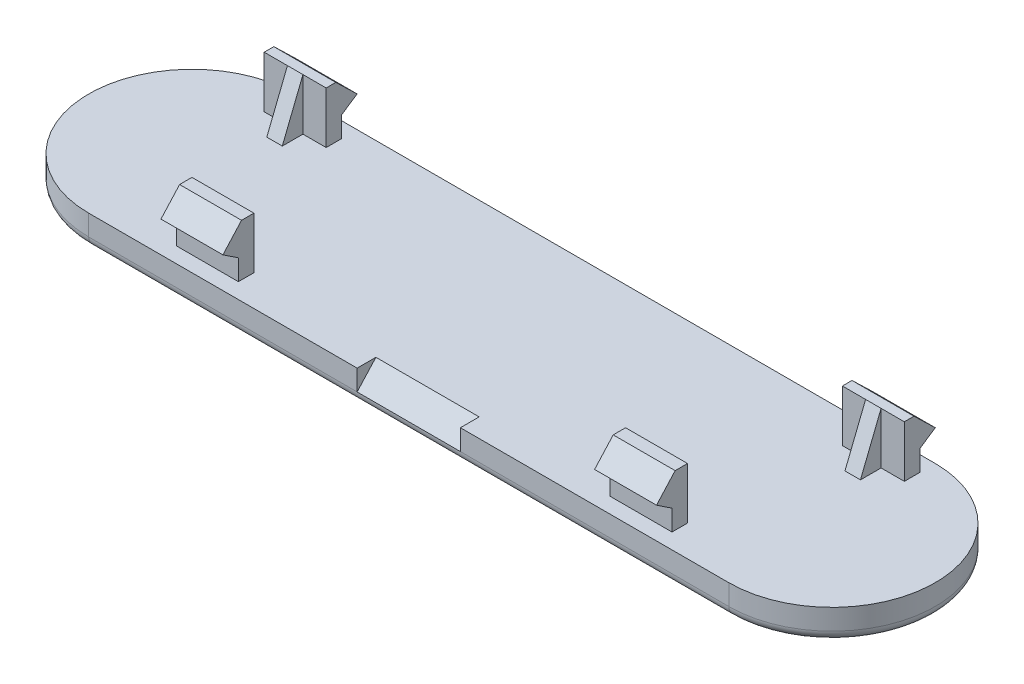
ISO-10303-21;
HEADER;
FILE_DESCRIPTION(('STEP AP214'),'2;1');
FILE_NAME('part.step','',(''),(''),'','','');
FILE_SCHEMA(('AUTOMOTIVE_DESIGN { 1 0 10303 214 1 1 1 1 }'));
ENDSEC;
DATA;
#1=APPLICATION_CONTEXT('core data for automotive mechanical design processes');
#2=APPLICATION_PROTOCOL_DEFINITION('international standard','automotive_design',2000,#1);
#3=PRODUCT_CONTEXT('',#1,'mechanical');
#4=PRODUCT('Part','Part','',(#3));
#5=PRODUCT_RELATED_PRODUCT_CATEGORY('part','',(#4));
#6=PRODUCT_DEFINITION_FORMATION('','',#4);
#7=PRODUCT_DEFINITION_CONTEXT('part definition',#1,'design');
#8=PRODUCT_DEFINITION('design','',#6,#7);
#9=PRODUCT_DEFINITION_SHAPE('','',#8);
#10=(LENGTH_UNIT() NAMED_UNIT(*) SI_UNIT(.MILLI.,.METRE.));
#11=(NAMED_UNIT(*) PLANE_ANGLE_UNIT() SI_UNIT($,.RADIAN.));
#12=(NAMED_UNIT(*) SI_UNIT($,.STERADIAN.) SOLID_ANGLE_UNIT());
#13=UNCERTAINTY_MEASURE_WITH_UNIT(LENGTH_MEASURE(1.E-05),#10,'distance_accuracy_value','');
#14=(GEOMETRIC_REPRESENTATION_CONTEXT(3) GLOBAL_UNCERTAINTY_ASSIGNED_CONTEXT((#13)) GLOBAL_UNIT_ASSIGNED_CONTEXT((#10,
#11,#12)) REPRESENTATION_CONTEXT('',''));
#15=CARTESIAN_POINT('',(0.,0.,0.));
#16=DIRECTION('',(0.,0.,1.));
#17=DIRECTION('',(1.,0.,0.));
#18=AXIS2_PLACEMENT_3D('',#15,#16,#17);
#19=CARTESIAN_POINT('',(31.,3.,0.));
#20=DIRECTION('',(0.,1.,0.));
#21=DIRECTION('',(0.,0.,1.));
#22=AXIS2_PLACEMENT_3D('',#19,#20,#21);
#23=PLANE('',#22);
#24=DIRECTION('',(1.,0.,0.));
#25=VECTOR('',#24,1.);
#26=CARTESIAN_POINT('',(-28.75,3.,-4.99999999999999));
#27=LINE('',#26,#25);
#28=CARTESIAN_POINT('',(-28.75,3.,-5.));
#29=VERTEX_POINT('',#28);
#30=CARTESIAN_POINT('',(-27.25,3.,-4.99999999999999));
#31=VERTEX_POINT('',#30);
#32=EDGE_CURVE('E759',#29,#31,#27,.T.);
#33=ORIENTED_EDGE('',*,*,#32,.F.);
#34=DIRECTION('',(0.,0.,1.));
#35=VECTOR('',#34,1.);
#36=CARTESIAN_POINT('',(-28.75,3.,-6.99999999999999));
#37=LINE('',#36,#35);
#38=CARTESIAN_POINT('',(-28.75,3.,-6.99999999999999));
#39=VERTEX_POINT('',#38);
#40=EDGE_CURVE('E347',#39,#29,#37,.T.);
#41=ORIENTED_EDGE('',*,*,#40,.F.);
#42=DIRECTION('',(1.,0.,0.));
#43=VECTOR('',#42,1.);
#44=CARTESIAN_POINT('',(-31.,3.,-6.99999999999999));
#45=LINE('',#44,#43);
#46=CARTESIAN_POINT('',(-31.,3.,-6.99999999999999));
#47=VERTEX_POINT('',#46);
#48=EDGE_CURVE('E379',#47,#39,#45,.T.);
#49=ORIENTED_EDGE('',*,*,#48,.F.);
#50=DIRECTION('',(0.,0.,1.));
#51=VECTOR('',#50,1.);
#52=CARTESIAN_POINT('',(-31.,3.,-9.99999999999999));
#53=LINE('',#52,#51);
#54=CARTESIAN_POINT('',(-31.,3.,-8.49999999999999));
#55=VERTEX_POINT('',#54);
#56=EDGE_CURVE('E388',#55,#47,#53,.T.);
#57=ORIENTED_EDGE('',*,*,#56,.F.);
#58=DIRECTION('',(-1.,0.,0.));
#59=VECTOR('',#58,1.);
#60=CARTESIAN_POINT('',(-25.,3.,-8.49999999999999));
#61=LINE('',#60,#59);
#62=CARTESIAN_POINT('',(-25.,3.,-8.49999999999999));
#63=VERTEX_POINT('',#62);
#64=EDGE_CURVE('E588',#63,#55,#61,.T.);
#65=ORIENTED_EDGE('',*,*,#64,.F.);
#66=DIRECTION('',(0.,0.,-1.));
#67=VECTOR('',#66,1.);
#68=CARTESIAN_POINT('',(-25.,3.,-9.99999999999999));
#69=LINE('',#68,#67);
#70=CARTESIAN_POINT('',(-25.,3.,-6.99999999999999));
#71=VERTEX_POINT('',#70);
#72=EDGE_CURVE('E374',#71,#63,#69,.T.);
#73=ORIENTED_EDGE('',*,*,#72,.F.);
#74=CARTESIAN_POINT('',(-27.25,3.,-6.99999999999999));
#75=VERTEX_POINT('',#74);
#76=EDGE_CURVE('E390',#75,#71,#45,.T.);
#77=ORIENTED_EDGE('',*,*,#76,.F.);
#78=DIRECTION('',(0.,0.,-1.));
#79=VECTOR('',#78,1.);
#80=CARTESIAN_POINT('',(-27.25,3.,-6.99999999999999));
#81=LINE('',#80,#79);
#82=EDGE_CURVE('E697',#31,#75,#81,.T.);
#83=ORIENTED_EDGE('',*,*,#82,.F.);
#84=EDGE_LOOP('',(#33,#41,#49,#57,#65,#73,#77,#83));
#85=FACE_BOUND('',#84,.T.);
#86=DIRECTION('',(1.,0.,0.));
#87=VECTOR('',#86,1.);
#88=CARTESIAN_POINT('',(27.25,3.,-5.));
#89=LINE('',#88,#87);
#90=CARTESIAN_POINT('',(27.25,3.,-5.));
#91=VERTEX_POINT('',#90);
#92=CARTESIAN_POINT('',(28.75,3.,-5.));
#93=VERTEX_POINT('',#92);
#94=EDGE_CURVE('E325',#91,#93,#89,.T.);
#95=ORIENTED_EDGE('',*,*,#94,.F.);
#96=DIRECTION('',(0.,0.,1.));
#97=VECTOR('',#96,1.);
#98=CARTESIAN_POINT('',(27.25,3.,-7.));
#99=LINE('',#98,#97);
#100=CARTESIAN_POINT('',(27.25,3.,-7.));
#101=VERTEX_POINT('',#100);
#102=EDGE_CURVE('E910',#101,#91,#99,.T.);
#103=ORIENTED_EDGE('',*,*,#102,.F.);
#104=DIRECTION('',(1.,0.,0.));
#105=VECTOR('',#104,1.);
#106=CARTESIAN_POINT('',(25.,3.,-7.));
#107=LINE('',#106,#105);
#108=CARTESIAN_POINT('',(25.,3.,-7.));
#109=VERTEX_POINT('',#108);
#110=EDGE_CURVE('E367',#109,#101,#107,.T.);
#111=ORIENTED_EDGE('',*,*,#110,.F.);
#112=DIRECTION('',(0.,0.,1.));
#113=VECTOR('',#112,1.);
#114=CARTESIAN_POINT('',(25.,3.,-7.));
#115=LINE('',#114,#113);
#116=CARTESIAN_POINT('',(25.,3.,-8.49999999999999));
#117=VERTEX_POINT('',#116);
#118=EDGE_CURVE('E363',#117,#109,#115,.T.);
#119=ORIENTED_EDGE('',*,*,#118,.F.);
#120=DIRECTION('',(-1.,0.,0.));
#121=VECTOR('',#120,1.);
#122=CARTESIAN_POINT('',(31.,3.,-8.49999999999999));
#123=LINE('',#122,#121);
#124=CARTESIAN_POINT('',(31.,3.,-8.49999999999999));
#125=VERTEX_POINT('',#124);
#126=EDGE_CURVE('E596',#125,#117,#123,.T.);
#127=ORIENTED_EDGE('',*,*,#126,.F.);
#128=DIRECTION('',(0.,0.,-1.));
#129=VECTOR('',#128,1.);
#130=CARTESIAN_POINT('',(31.,3.,-7.));
#131=LINE('',#130,#129);
#132=CARTESIAN_POINT('',(31.,3.,-7.));
#133=VERTEX_POINT('',#132);
#134=EDGE_CURVE('E360',#133,#125,#131,.T.);
#135=ORIENTED_EDGE('',*,*,#134,.F.);
#136=CARTESIAN_POINT('',(28.75,3.,-7.));
#137=VERTEX_POINT('',#136);
#138=EDGE_CURVE('E366',#137,#133,#107,.T.);
#139=ORIENTED_EDGE('',*,*,#138,.F.);
#140=DIRECTION('',(0.,0.,-1.));
#141=VECTOR('',#140,1.);
#142=CARTESIAN_POINT('',(28.75,3.,-7.));
#143=LINE('',#142,#141);
#144=EDGE_CURVE('E344',#93,#137,#143,.T.);
#145=ORIENTED_EDGE('',*,*,#144,.F.);
#146=EDGE_LOOP('',(#95,#103,#111,#119,#127,#135,#139,#145));
#147=FACE_BOUND('',#146,.T.);
#148=DIRECTION('',(0.,0.,1.));
#149=VECTOR('',#148,1.);
#150=CARTESIAN_POINT('',(-21.75,3.,7.));
#151=LINE('',#150,#149);
#152=CARTESIAN_POINT('',(-21.75,3.,5.));
#153=VERTEX_POINT('',#152);
#154=CARTESIAN_POINT('',(-21.75,3.,7.));
#155=VERTEX_POINT('',#154);
#156=EDGE_CURVE('E900',#153,#155,#151,.T.);
#157=ORIENTED_EDGE('',*,*,#156,.F.);
#158=DIRECTION('',(-1.,0.,0.));
#159=VECTOR('',#158,1.);
#160=CARTESIAN_POINT('',(-21.75,3.,5.));
#161=LINE('',#160,#159);
#162=CARTESIAN_POINT('',(-20.25,3.,5.));
#163=VERTEX_POINT('',#162);
#164=EDGE_CURVE('E905',#163,#153,#161,.T.);
#165=ORIENTED_EDGE('',*,*,#164,.F.);
#166=DIRECTION('',(0.,0.,-1.));
#167=VECTOR('',#166,1.);
#168=CARTESIAN_POINT('',(-20.25,3.,7.));
#169=LINE('',#168,#167);
#170=CARTESIAN_POINT('',(-20.25,3.,7.));
#171=VERTEX_POINT('',#170);
#172=EDGE_CURVE('E902',#171,#163,#169,.T.);
#173=ORIENTED_EDGE('',*,*,#172,.F.);
#174=DIRECTION('',(-1.,0.,0.));
#175=VECTOR('',#174,1.);
#176=CARTESIAN_POINT('',(-24.,3.,7.));
#177=LINE('',#176,#175);
#178=CARTESIAN_POINT('',(-18.,3.,7.));
#179=VERTEX_POINT('',#178);
#180=EDGE_CURVE('E434',#179,#171,#177,.T.);
#181=ORIENTED_EDGE('',*,*,#180,.F.);
#182=DIRECTION('',(0.,0.,-1.));
#183=VECTOR('',#182,1.);
#184=CARTESIAN_POINT('',(-18.,3.,7.));
#185=LINE('',#184,#183);
#186=CARTESIAN_POINT('',(-18.,3.,8.5));
#187=VERTEX_POINT('',#186);
#188=EDGE_CURVE('E422',#187,#179,#185,.T.);
#189=ORIENTED_EDGE('',*,*,#188,.F.);
#190=DIRECTION('',(1.,0.,0.));
#191=VECTOR('',#190,1.);
#192=CARTESIAN_POINT('',(-24.,3.,8.5));
#193=LINE('',#192,#191);
#194=CARTESIAN_POINT('',(-24.,3.,8.5));
#195=VERTEX_POINT('',#194);
#196=EDGE_CURVE('E570',#195,#187,#193,.T.);
#197=ORIENTED_EDGE('',*,*,#196,.F.);
#198=DIRECTION('',(0.,0.,1.));
#199=VECTOR('',#198,1.);
#200=CARTESIAN_POINT('',(-24.,3.,7.));
#201=LINE('',#200,#199);
#202=CARTESIAN_POINT('',(-24.,3.,7.));
#203=VERTEX_POINT('',#202);
#204=EDGE_CURVE('E426',#203,#195,#201,.T.);
#205=ORIENTED_EDGE('',*,*,#204,.F.);
#206=EDGE_CURVE('E437',#155,#203,#177,.T.);
#207=ORIENTED_EDGE('',*,*,#206,.F.);
#208=EDGE_LOOP('',(#157,#165,#173,#181,#189,#197,#205,#207));
#209=FACE_BOUND('',#208,.T.);
#210=DIRECTION('',(0.,0.,1.));
#211=VECTOR('',#210,1.);
#212=CARTESIAN_POINT('',(20.25,3.,7.));
#213=LINE('',#212,#211);
#214=CARTESIAN_POINT('',(20.25,3.,5.));
#215=VERTEX_POINT('',#214);
#216=CARTESIAN_POINT('',(20.25,3.,7.));
#217=VERTEX_POINT('',#216);
#218=EDGE_CURVE('E891',#215,#217,#213,.T.);
#219=ORIENTED_EDGE('',*,*,#218,.F.);
#220=DIRECTION('',(-1.,0.,0.));
#221=VECTOR('',#220,1.);
#222=CARTESIAN_POINT('',(20.25,3.,5.00000000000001));
#223=LINE('',#222,#221);
#224=CARTESIAN_POINT('',(21.75,3.,5.));
#225=VERTEX_POINT('',#224);
#226=EDGE_CURVE('E878',#225,#215,#223,.T.);
#227=ORIENTED_EDGE('',*,*,#226,.F.);
#228=DIRECTION('',(0.,0.,-1.));
#229=VECTOR('',#228,1.);
#230=CARTESIAN_POINT('',(21.75,3.,7.));
#231=LINE('',#230,#229);
#232=CARTESIAN_POINT('',(21.75,3.,7.));
#233=VERTEX_POINT('',#232);
#234=EDGE_CURVE('E890',#233,#225,#231,.T.);
#235=ORIENTED_EDGE('',*,*,#234,.F.);
#236=DIRECTION('',(-1.,0.,0.));
#237=VECTOR('',#236,1.);
#238=CARTESIAN_POINT('',(18.,3.,7.));
#239=LINE('',#238,#237);
#240=CARTESIAN_POINT('',(24.,3.,7.));
#241=VERTEX_POINT('',#240);
#242=EDGE_CURVE('E412',#241,#233,#239,.T.);
#243=ORIENTED_EDGE('',*,*,#242,.F.);
#244=DIRECTION('',(0.,0.,-1.));
#245=VECTOR('',#244,1.);
#246=CARTESIAN_POINT('',(24.,3.,10.));
#247=LINE('',#246,#245);
#248=CARTESIAN_POINT('',(24.,3.,8.5));
#249=VERTEX_POINT('',#248);
#250=EDGE_CURVE('E398',#249,#241,#247,.T.);
#251=ORIENTED_EDGE('',*,*,#250,.F.);
#252=DIRECTION('',(1.,0.,0.));
#253=VECTOR('',#252,1.);
#254=CARTESIAN_POINT('',(18.,3.,8.5));
#255=LINE('',#254,#253);
#256=CARTESIAN_POINT('',(18.,3.,8.5));
#257=VERTEX_POINT('',#256);
#258=EDGE_CURVE('E624',#257,#249,#255,.T.);
#259=ORIENTED_EDGE('',*,*,#258,.F.);
#260=DIRECTION('',(0.,0.,1.));
#261=VECTOR('',#260,1.);
#262=CARTESIAN_POINT('',(18.,3.,10.));
#263=LINE('',#262,#261);
#264=CARTESIAN_POINT('',(18.,3.,7.));
#265=VERTEX_POINT('',#264);
#266=EDGE_CURVE('E402',#265,#257,#263,.T.);
#267=ORIENTED_EDGE('',*,*,#266,.F.);
#268=EDGE_CURVE('E411',#217,#265,#239,.T.);
#269=ORIENTED_EDGE('',*,*,#268,.F.);
#270=EDGE_LOOP('',(#219,#227,#235,#243,#251,#259,#267,#269));
#271=FACE_BOUND('',#270,.T.);
#272=DIRECTION('',(0.,0.,-1.));
#273=VECTOR('',#272,1.);
#274=CARTESIAN_POINT('',(5.,3.,12.1822910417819));
#275=LINE('',#274,#273);
#276=CARTESIAN_POINT('',(5.,3.,10.));
#277=VERTEX_POINT('',#276);
#278=CARTESIAN_POINT('',(5.,3.,8.18229104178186));
#279=VERTEX_POINT('',#278);
#280=EDGE_CURVE('E767',#277,#279,#275,.T.);
#281=ORIENTED_EDGE('',*,*,#280,.F.);
#282=DIRECTION('',(1.,0.,0.));
#283=VECTOR('',#282,1.);
#284=CARTESIAN_POINT('',(31.,3.,9.99999999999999));
#285=LINE('',#284,#283);
#286=CARTESIAN_POINT('',(31.,3.,9.99999999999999));
#287=VERTEX_POINT('',#286);
#288=EDGE_CURVE('E448',#277,#287,#285,.T.);
#289=ORIENTED_EDGE('',*,*,#288,.T.);
#290=CARTESIAN_POINT('',(31.,3.,0.));
#291=DIRECTION('',(0.,1.,0.));
#292=DIRECTION('',(0.,0.,1.));
#293=AXIS2_PLACEMENT_3D('',#290,#291,#292);
#294=CIRCLE('',#293,9.99999999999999);
#295=CARTESIAN_POINT('',(31.,3.,-9.99999999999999));
#296=VERTEX_POINT('',#295);
#297=EDGE_CURVE('E515',#287,#296,#294,.T.);
#298=ORIENTED_EDGE('',*,*,#297,.T.);
#299=DIRECTION('',(-1.,0.,0.));
#300=VECTOR('',#299,1.);
#301=CARTESIAN_POINT('',(31.,3.,-9.99999999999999));
#302=LINE('',#301,#300);
#303=CARTESIAN_POINT('',(-31.,3.,-9.99999999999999));
#304=VERTEX_POINT('',#303);
#305=EDGE_CURVE('E539',#296,#304,#302,.T.);
#306=ORIENTED_EDGE('',*,*,#305,.T.);
#307=CARTESIAN_POINT('',(-31.,3.,0.));
#308=DIRECTION('',(0.,1.,0.));
#309=DIRECTION('',(0.,0.,1.));
#310=AXIS2_PLACEMENT_3D('',#307,#308,#309);
#311=CIRCLE('',#310,9.99999999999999);
#312=CARTESIAN_POINT('',(-31.,3.,10.));
#313=VERTEX_POINT('',#312);
#314=EDGE_CURVE('E451',#304,#313,#311,.T.);
#315=ORIENTED_EDGE('',*,*,#314,.T.);
#316=CARTESIAN_POINT('',(-5.,3.,10.));
#317=VERTEX_POINT('',#316);
#318=EDGE_CURVE('E450',#313,#317,#285,.T.);
#319=ORIENTED_EDGE('',*,*,#318,.T.);
#320=DIRECTION('',(0.,0.,1.));
#321=VECTOR('',#320,1.);
#322=CARTESIAN_POINT('',(-5.,3.,12.1822910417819));
#323=LINE('',#322,#321);
#324=CARTESIAN_POINT('',(-5.,3.,8.18229104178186));
#325=VERTEX_POINT('',#324);
#326=EDGE_CURVE('E715',#325,#317,#323,.T.);
#327=ORIENTED_EDGE('',*,*,#326,.F.);
#328=DIRECTION('',(-1.,0.,0.));
#329=VECTOR('',#328,1.);
#330=CARTESIAN_POINT('',(-5.,3.,8.18229104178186));
#331=LINE('',#330,#329);
#332=EDGE_CURVE('E718',#279,#325,#331,.T.);
#333=ORIENTED_EDGE('',*,*,#332,.F.);
#334=EDGE_LOOP('',(#281,#289,#298,#306,#315,#319,#327,#333));
#335=FACE_BOUND('',#334,.T.);
#336=ADVANCED_FACE('F33',(#85,#147,#209,#271,#335),#23,.T.);
#337=CARTESIAN_POINT('',(18.,8.,7.));
#338=DIRECTION('',(0.,0.,1.));
#339=DIRECTION('',(1.,0.,0.));
#340=AXIS2_PLACEMENT_3D('',#337,#338,#339);
#341=PLANE('',#340);
#342=DIRECTION('',(0.,-1.,0.));
#343=VECTOR('',#342,1.);
#344=CARTESIAN_POINT('',(20.25,8.,7.));
#345=LINE('',#344,#343);
#346=CARTESIAN_POINT('',(20.25,8.,7.));
#347=VERTEX_POINT('',#346);
#348=EDGE_CURVE('E877',#347,#217,#345,.T.);
#349=ORIENTED_EDGE('',*,*,#348,.T.);
#350=ORIENTED_EDGE('',*,*,#268,.T.);
#351=DIRECTION('',(0.,-1.,0.));
#352=VECTOR('',#351,1.);
#353=CARTESIAN_POINT('',(18.,8.,7.));
#354=LINE('',#353,#352);
#355=CARTESIAN_POINT('',(18.,8.,7.));
#356=VERTEX_POINT('',#355);
#357=EDGE_CURVE('E409',#356,#265,#354,.T.);
#358=ORIENTED_EDGE('',*,*,#357,.F.);
#359=DIRECTION('',(-1.,0.,0.));
#360=VECTOR('',#359,1.);
#361=CARTESIAN_POINT('',(18.,8.,7.));
#362=LINE('',#361,#360);
#363=EDGE_CURVE('E401',#347,#356,#362,.T.);
#364=ORIENTED_EDGE('',*,*,#363,.F.);
#365=EDGE_LOOP('',(#349,#350,#358,#364));
#366=FACE_BOUND('',#365,.T.);
#367=ADVANCED_FACE('F788',(#366),#341,.F.);
#368=DIRECTION('',(0.,-1.,0.));
#369=VECTOR('',#368,1.);
#370=CARTESIAN_POINT('',(21.75,8.,7.));
#371=LINE('',#370,#369);
#372=CARTESIAN_POINT('',(21.75,8.,7.));
#373=VERTEX_POINT('',#372);
#374=EDGE_CURVE('E870',#373,#233,#371,.T.);
#375=ORIENTED_EDGE('',*,*,#374,.F.);
#376=CARTESIAN_POINT('',(24.,8.,7.));
#377=VERTEX_POINT('',#376);
#378=EDGE_CURVE('E403',#377,#373,#362,.T.);
#379=ORIENTED_EDGE('',*,*,#378,.F.);
#380=DIRECTION('',(0.,-1.,0.));
#381=VECTOR('',#380,1.);
#382=CARTESIAN_POINT('',(24.,8.,7.));
#383=LINE('',#382,#381);
#384=EDGE_CURVE('E419',#377,#241,#383,.T.);
#385=ORIENTED_EDGE('',*,*,#384,.T.);
#386=ORIENTED_EDGE('',*,*,#242,.T.);
#387=EDGE_LOOP('',(#375,#379,#385,#386));
#388=FACE_BOUND('',#387,.T.);
#389=ADVANCED_FACE('F794',(#388),#341,.F.);
#390=CARTESIAN_POINT('',(-24.,8.,7.));
#391=DIRECTION('',(0.,0.,1.));
#392=DIRECTION('',(1.,0.,0.));
#393=AXIS2_PLACEMENT_3D('',#390,#391,#392);
#394=PLANE('',#393);
#395=DIRECTION('',(0.,-1.,0.));
#396=VECTOR('',#395,1.);
#397=CARTESIAN_POINT('',(-21.75,8.,7.));
#398=LINE('',#397,#396);
#399=CARTESIAN_POINT('',(-21.75,8.,7.));
#400=VERTEX_POINT('',#399);
#401=EDGE_CURVE('E564',#400,#155,#398,.T.);
#402=ORIENTED_EDGE('',*,*,#401,.T.);
#403=ORIENTED_EDGE('',*,*,#206,.T.);
#404=DIRECTION('',(0.,-1.,0.));
#405=VECTOR('',#404,1.);
#406=CARTESIAN_POINT('',(-24.,8.,7.));
#407=LINE('',#406,#405);
#408=CARTESIAN_POINT('',(-24.,8.,7.));
#409=VERTEX_POINT('',#408);
#410=EDGE_CURVE('E433',#409,#203,#407,.T.);
#411=ORIENTED_EDGE('',*,*,#410,.F.);
#412=DIRECTION('',(-1.,0.,0.));
#413=VECTOR('',#412,1.);
#414=CARTESIAN_POINT('',(-24.,8.,7.));
#415=LINE('',#414,#413);
#416=EDGE_CURVE('E425',#400,#409,#415,.T.);
#417=ORIENTED_EDGE('',*,*,#416,.F.);
#418=EDGE_LOOP('',(#402,#403,#411,#417));
#419=FACE_BOUND('',#418,.T.);
#420=ADVANCED_FACE('F561',(#419),#394,.F.);
#421=DIRECTION('',(0.,-1.,0.));
#422=VECTOR('',#421,1.);
#423=CARTESIAN_POINT('',(-20.25,8.,7.));
#424=LINE('',#423,#422);
#425=CARTESIAN_POINT('',(-20.25,8.,7.));
#426=VERTEX_POINT('',#425);
#427=EDGE_CURVE('E907',#426,#171,#424,.T.);
#428=ORIENTED_EDGE('',*,*,#427,.F.);
#429=CARTESIAN_POINT('',(-18.,8.,7.));
#430=VERTEX_POINT('',#429);
#431=EDGE_CURVE('E427',#430,#426,#415,.T.);
#432=ORIENTED_EDGE('',*,*,#431,.F.);
#433=DIRECTION('',(0.,-1.,0.));
#434=VECTOR('',#433,1.);
#435=CARTESIAN_POINT('',(-18.,8.,7.));
#436=LINE('',#435,#434);
#437=EDGE_CURVE('E543',#430,#179,#436,.T.);
#438=ORIENTED_EDGE('',*,*,#437,.T.);
#439=ORIENTED_EDGE('',*,*,#180,.T.);
#440=EDGE_LOOP('',(#428,#432,#438,#439));
#441=FACE_BOUND('',#440,.T.);
#442=ADVANCED_FACE('F833',(#441),#394,.F.);
#443=CARTESIAN_POINT('',(25.,8.,-7.));
#444=DIRECTION('',(0.,0.,-1.));
#445=DIRECTION('',(-1.,0.,0.));
#446=AXIS2_PLACEMENT_3D('',#443,#444,#445);
#447=PLANE('',#446);
#448=DIRECTION('',(0.,-1.,0.));
#449=VECTOR('',#448,1.);
#450=CARTESIAN_POINT('',(27.25,8.,-7.));
#451=LINE('',#450,#449);
#452=CARTESIAN_POINT('',(27.25,8.,-7.));
#453=VERTEX_POINT('',#452);
#454=EDGE_CURVE('E348',#453,#101,#451,.T.);
#455=ORIENTED_EDGE('',*,*,#454,.F.);
#456=DIRECTION('',(1.,0.,0.));
#457=VECTOR('',#456,1.);
#458=CARTESIAN_POINT('',(25.,8.,-7.));
#459=LINE('',#458,#457);
#460=CARTESIAN_POINT('',(25.,8.,-7.));
#461=VERTEX_POINT('',#460);
#462=EDGE_CURVE('E338',#461,#453,#459,.T.);
#463=ORIENTED_EDGE('',*,*,#462,.F.);
#464=DIRECTION('',(0.,-1.,0.));
#465=VECTOR('',#464,1.);
#466=CARTESIAN_POINT('',(25.,8.,-7.));
#467=LINE('',#466,#465);
#468=EDGE_CURVE('E371',#461,#109,#467,.T.);
#469=ORIENTED_EDGE('',*,*,#468,.T.);
#470=ORIENTED_EDGE('',*,*,#110,.T.);
#471=EDGE_LOOP('',(#455,#463,#469,#470));
#472=FACE_BOUND('',#471,.T.);
#473=ADVANCED_FACE('F749',(#472),#447,.F.);
#474=DIRECTION('',(0.,-1.,0.));
#475=VECTOR('',#474,1.);
#476=CARTESIAN_POINT('',(28.75,8.,-7.));
#477=LINE('',#476,#475);
#478=CARTESIAN_POINT('',(28.75,8.,-7.));
#479=VERTEX_POINT('',#478);
#480=EDGE_CURVE('E342',#479,#137,#477,.T.);
#481=ORIENTED_EDGE('',*,*,#480,.T.);
#482=ORIENTED_EDGE('',*,*,#138,.T.);
#483=DIRECTION('',(0.,-1.,0.));
#484=VECTOR('',#483,1.);
#485=CARTESIAN_POINT('',(31.,8.,-7.));
#486=LINE('',#485,#484);
#487=CARTESIAN_POINT('',(31.,8.,-7.));
#488=VERTEX_POINT('',#487);
#489=EDGE_CURVE('E352',#488,#133,#486,.T.);
#490=ORIENTED_EDGE('',*,*,#489,.F.);
#491=EDGE_CURVE('E335',#479,#488,#459,.T.);
#492=ORIENTED_EDGE('',*,*,#491,.F.);
#493=EDGE_LOOP('',(#481,#482,#490,#492));
#494=FACE_BOUND('',#493,.T.);
#495=ADVANCED_FACE('F350',(#494),#447,.F.);
#496=CARTESIAN_POINT('',(-31.,8.,-6.99999999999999));
#497=DIRECTION('',(0.,0.,-1.));
#498=DIRECTION('',(-1.,0.,0.));
#499=AXIS2_PLACEMENT_3D('',#496,#497,#498);
#500=PLANE('',#499);
#501=DIRECTION('',(0.,-1.,0.));
#502=VECTOR('',#501,1.);
#503=CARTESIAN_POINT('',(-28.75,8.,-6.99999999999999));
#504=LINE('',#503,#502);
#505=CARTESIAN_POINT('',(-28.75,8.,-7.));
#506=VERTEX_POINT('',#505);
#507=EDGE_CURVE('E683',#506,#39,#504,.T.);
#508=ORIENTED_EDGE('',*,*,#507,.F.);
#509=DIRECTION('',(1.,0.,0.));
#510=VECTOR('',#509,1.);
#511=CARTESIAN_POINT('',(-31.,8.,-6.99999999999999));
#512=LINE('',#511,#510);
#513=CARTESIAN_POINT('',(-31.,8.,-6.99999999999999));
#514=VERTEX_POINT('',#513);
#515=EDGE_CURVE('E382',#514,#506,#512,.T.);
#516=ORIENTED_EDGE('',*,*,#515,.F.);
#517=DIRECTION('',(0.,-1.,0.));
#518=VECTOR('',#517,1.);
#519=CARTESIAN_POINT('',(-31.,8.,-6.99999999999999));
#520=LINE('',#519,#518);
#521=EDGE_CURVE('E395',#514,#47,#520,.T.);
#522=ORIENTED_EDGE('',*,*,#521,.T.);
#523=ORIENTED_EDGE('',*,*,#48,.T.);
#524=EDGE_LOOP('',(#508,#516,#522,#523));
#525=FACE_BOUND('',#524,.T.);
#526=ADVANCED_FACE('F682',(#525),#500,.F.);
#527=DIRECTION('',(0.,-1.,0.));
#528=VECTOR('',#527,1.);
#529=CARTESIAN_POINT('',(-27.25,8.,-6.99999999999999));
#530=LINE('',#529,#528);
#531=CARTESIAN_POINT('',(-27.25,8.,-7.));
#532=VERTEX_POINT('',#531);
#533=EDGE_CURVE('E693',#532,#75,#530,.T.);
#534=ORIENTED_EDGE('',*,*,#533,.T.);
#535=ORIENTED_EDGE('',*,*,#76,.T.);
#536=DIRECTION('',(0.,-1.,0.));
#537=VECTOR('',#536,1.);
#538=CARTESIAN_POINT('',(-25.,8.,-6.99999999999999));
#539=LINE('',#538,#537);
#540=CARTESIAN_POINT('',(-25.,8.,-6.99999999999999));
#541=VERTEX_POINT('',#540);
#542=EDGE_CURVE('E385',#541,#71,#539,.T.);
#543=ORIENTED_EDGE('',*,*,#542,.F.);
#544=EDGE_CURVE('E381',#532,#541,#512,.T.);
#545=ORIENTED_EDGE('',*,*,#544,.F.);
#546=EDGE_LOOP('',(#534,#535,#543,#545));
#547=FACE_BOUND('',#546,.T.);
#548=ADVANCED_FACE('F702',(#547),#500,.F.);
#549=CARTESIAN_POINT('',(5.,1.,12.1822910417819));
#550=DIRECTION('',(1.,0.,0.));
#551=DIRECTION('',(0.,0.,-1.));
#552=AXIS2_PLACEMENT_3D('',#549,#550,#551);
#553=PLANE('',#552);
#554=DIRECTION('',(0.,-0.740027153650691,0.672576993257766));
#555=VECTOR('',#554,1.);
#556=CARTESIAN_POINT('',(4.99999999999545,3.,8.18229104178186));
#557=LINE('',#556,#555);
#558=CARTESIAN_POINT('',(5.,1.,10.));
#559=VERTEX_POINT('',#558);
#560=EDGE_CURVE('E765',#279,#559,#557,.T.);
#561=ORIENTED_EDGE('',*,*,#560,.T.);
#562=DIRECTION('',(0.,-1.,0.));
#563=VECTOR('',#562,1.);
#564=CARTESIAN_POINT('',(5.,3.,10.));
#565=LINE('',#564,#563);
#566=EDGE_CURVE('E11',#277,#559,#565,.T.);
#567=ORIENTED_EDGE('',*,*,#566,.F.);
#568=ORIENTED_EDGE('',*,*,#280,.T.);
#569=EDGE_LOOP('',(#561,#567,#568));
#570=FACE_BOUND('',#569,.T.);
#571=ADVANCED_FACE('F776',(#570),#553,.F.);
#572=CARTESIAN_POINT('',(-5.,1.,12.1822910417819));
#573=DIRECTION('',(-1.,0.,0.));
#574=DIRECTION('',(0.,0.,1.));
#575=AXIS2_PLACEMENT_3D('',#572,#573,#574);
#576=PLANE('',#575);
#577=DIRECTION('',(0.,-0.740027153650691,0.672576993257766));
#578=VECTOR('',#577,1.);
#579=CARTESIAN_POINT('',(-5.,3.,8.18229104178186));
#580=LINE('',#579,#578);
#581=CARTESIAN_POINT('',(-5.,1.,10.));
#582=VERTEX_POINT('',#581);
#583=EDGE_CURVE('E700',#325,#582,#580,.T.);
#584=ORIENTED_EDGE('',*,*,#583,.F.);
#585=ORIENTED_EDGE('',*,*,#326,.T.);
#586=DIRECTION('',(0.,1.,0.));
#587=VECTOR('',#586,1.);
#588=CARTESIAN_POINT('',(-5.,3.,10.));
#589=LINE('',#588,#587);
#590=EDGE_CURVE('E41',#582,#317,#589,.T.);
#591=ORIENTED_EDGE('',*,*,#590,.F.);
#592=EDGE_LOOP('',(#584,#585,#591));
#593=FACE_BOUND('',#592,.T.);
#594=ADVANCED_FACE('F774',(#593),#576,.F.);
#595=CARTESIAN_POINT('',(31.,3.,9.99999999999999));
#596=DIRECTION('',(0.,0.,-1.));
#597=DIRECTION('',(-1.,0.,0.));
#598=AXIS2_PLACEMENT_3D('',#595,#596,#597);
#599=PLANE('',#598);
#600=ORIENTED_EDGE('',*,*,#288,.F.);
#601=ORIENTED_EDGE('',*,*,#566,.T.);
#602=DIRECTION('',(-1.,0.,0.));
#603=VECTOR('',#602,1.);
#604=CARTESIAN_POINT('',(31.,1.,9.99999999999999));
#605=LINE('',#604,#603);
#606=CARTESIAN_POINT('',(31.,1.,9.99999999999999));
#607=VERTEX_POINT('',#606);
#608=EDGE_CURVE('E474',#559,#607,#605,.F.);
#609=ORIENTED_EDGE('',*,*,#608,.T.);
#610=DIRECTION('',(0.,-1.,0.));
#611=VECTOR('',#610,1.);
#612=CARTESIAN_POINT('',(31.,3.,9.99999999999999));
#613=LINE('',#612,#611);
#614=EDGE_CURVE('E456',#287,#607,#613,.T.);
#615=ORIENTED_EDGE('',*,*,#614,.F.);
#616=EDGE_LOOP('',(#600,#601,#609,#615));
#617=FACE_BOUND('',#616,.T.);
#618=ADVANCED_FACE('F518',(#617),#599,.F.);
#619=CARTESIAN_POINT('',(-25.,8.,-9.99999999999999));
#620=DIRECTION('',(-1.,0.,0.));
#621=DIRECTION('',(0.,0.,1.));
#622=AXIS2_PLACEMENT_3D('',#619,#620,#621);
#623=PLANE('',#622);
#624=DIRECTION('',(0.,-0.554700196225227,0.832050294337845));
#625=VECTOR('',#624,1.);
#626=CARTESIAN_POINT('',(-25.,6.,-9.99999999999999));
#627=LINE('',#626,#625);
#628=CARTESIAN_POINT('',(-25.,6.,-9.99999999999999));
#629=VERTEX_POINT('',#628);
#630=CARTESIAN_POINT('',(-25.,5.,-8.49999999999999));
#631=VERTEX_POINT('',#630);
#632=EDGE_CURVE('E709',#629,#631,#627,.T.);
#633=ORIENTED_EDGE('',*,*,#632,.F.);
#634=DIRECTION('',(0.,-0.695255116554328,-0.718763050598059));
#635=VECTOR('',#634,1.);
#636=CARTESIAN_POINT('',(-25.,6.96675935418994,-9.000552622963));
#637=LINE('',#636,#635);
#638=CARTESIAN_POINT('',(-24.9999999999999,8.,-7.93237609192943));
#639=VERTEX_POINT('',#638);
#640=EDGE_CURVE('E615',#639,#629,#637,.T.);
#641=ORIENTED_EDGE('',*,*,#640,.F.);
#642=DIRECTION('',(0.,0.,-1.));
#643=VECTOR('',#642,1.);
#644=CARTESIAN_POINT('',(-25.,8.,-9.99999999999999));
#645=LINE('',#644,#643);
#646=EDGE_CURVE('E375',#541,#639,#645,.T.);
#647=ORIENTED_EDGE('',*,*,#646,.F.);
#648=ORIENTED_EDGE('',*,*,#542,.T.);
#649=ORIENTED_EDGE('',*,*,#72,.T.);
#650=DIRECTION('',(0.,-1.,0.));
#651=VECTOR('',#650,1.);
#652=CARTESIAN_POINT('',(-25.,3.,-8.49999999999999));
#653=LINE('',#652,#651);
#654=EDGE_CURVE('E586',#631,#63,#653,.T.);
#655=ORIENTED_EDGE('',*,*,#654,.F.);
#656=EDGE_LOOP('',(#633,#641,#647,#648,#649,#655));
#657=FACE_BOUND('',#656,.T.);
#658=ADVANCED_FACE('F706',(#657),#623,.F.);
#659=CARTESIAN_POINT('',(-31.,8.,-9.99999999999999));
#660=DIRECTION('',(1.,0.,0.));
#661=DIRECTION('',(0.,0.,-1.));
#662=AXIS2_PLACEMENT_3D('',#659,#660,#661);
#663=PLANE('',#662);
#664=DIRECTION('',(0.,0.695255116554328,0.718763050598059));
#665=VECTOR('',#664,1.);
#666=CARTESIAN_POINT('',(-31.,6.96675935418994,-9.000552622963));
#667=LINE('',#666,#665);
#668=CARTESIAN_POINT('',(-30.9999999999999,6.,-9.99999999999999));
#669=VERTEX_POINT('',#668);
#670=CARTESIAN_POINT('',(-30.9999999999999,8.,-7.93237609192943));
#671=VERTEX_POINT('',#670);
#672=EDGE_CURVE('E612',#669,#671,#667,.T.);
#673=ORIENTED_EDGE('',*,*,#672,.F.);
#674=DIRECTION('',(0.,-0.554700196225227,0.832050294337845));
#675=VECTOR('',#674,1.);
#676=CARTESIAN_POINT('',(-31.,6.,-9.99999999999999));
#677=LINE('',#676,#675);
#678=CARTESIAN_POINT('',(-31.,5.,-8.49999999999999));
#679=VERTEX_POINT('',#678);
#680=EDGE_CURVE('E713',#669,#679,#677,.T.);
#681=ORIENTED_EDGE('',*,*,#680,.T.);
#682=DIRECTION('',(0.,1.,0.));
#683=VECTOR('',#682,1.);
#684=CARTESIAN_POINT('',(-31.,3.,-8.49999999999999));
#685=LINE('',#684,#683);
#686=EDGE_CURVE('E55',#55,#679,#685,.T.);
#687=ORIENTED_EDGE('',*,*,#686,.F.);
#688=ORIENTED_EDGE('',*,*,#56,.T.);
#689=ORIENTED_EDGE('',*,*,#521,.F.);
#690=DIRECTION('',(0.,0.,1.));
#691=VECTOR('',#690,1.);
#692=CARTESIAN_POINT('',(-31.,8.,-9.99999999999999));
#693=LINE('',#692,#691);
#694=EDGE_CURVE('E378',#671,#514,#693,.T.);
#695=ORIENTED_EDGE('',*,*,#694,.F.);
#696=EDGE_LOOP('',(#673,#681,#687,#688,#689,#695));
#697=FACE_BOUND('',#696,.T.);
#698=ADVANCED_FACE('F674',(#697),#663,.F.);
#699=CARTESIAN_POINT('',(0.,8.,0.));
#700=DIRECTION('',(0.,1.,0.));
#701=DIRECTION('',(0.,0.,1.));
#702=AXIS2_PLACEMENT_3D('',#699,#700,#701);
#703=PLANE('',#702);
#704=DIRECTION('',(1.,0.,0.));
#705=VECTOR('',#704,1.);
#706=CARTESIAN_POINT('',(-41.,8.,-7.));
#707=LINE('',#706,#705);
#708=EDGE_CURVE('E339',#506,#532,#707,.T.);
#709=ORIENTED_EDGE('',*,*,#708,.T.);
#710=ORIENTED_EDGE('',*,*,#544,.T.);
#711=ORIENTED_EDGE('',*,*,#646,.T.);
#712=DIRECTION('',(-1.,0.,0.));
#713=VECTOR('',#712,1.);
#714=CARTESIAN_POINT('',(153.227591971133,8.,-7.93237609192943));
#715=LINE('',#714,#713);
#716=EDGE_CURVE('E662',#639,#671,#715,.T.);
#717=ORIENTED_EDGE('',*,*,#716,.T.);
#718=ORIENTED_EDGE('',*,*,#694,.T.);
#719=ORIENTED_EDGE('',*,*,#515,.T.);
#720=EDGE_LOOP('',(#709,#710,#711,#717,#718,#719));
#721=FACE_BOUND('',#720,.T.);
#722=ADVANCED_FACE('F667',(#721),#703,.T.);
#723=CARTESIAN_POINT('',(31.,8.,-7.));
#724=DIRECTION('',(-1.,0.,0.));
#725=DIRECTION('',(0.,0.,1.));
#726=AXIS2_PLACEMENT_3D('',#723,#724,#725);
#727=PLANE('',#726);
#728=DIRECTION('',(0.,0.554700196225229,-0.832050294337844));
#729=VECTOR('',#728,1.);
#730=CARTESIAN_POINT('',(31.,6.,-9.99999999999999));
#731=LINE('',#730,#729);
#732=CARTESIAN_POINT('',(31.,5.,-8.49999999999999));
#733=VERTEX_POINT('',#732);
#734=CARTESIAN_POINT('',(31.,6.,-9.99999999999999));
#735=VERTEX_POINT('',#734);
#736=EDGE_CURVE('E610',#733,#735,#731,.T.);
#737=ORIENTED_EDGE('',*,*,#736,.T.);
#738=DIRECTION('',(0.,-0.695255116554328,-0.718763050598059));
#739=VECTOR('',#738,1.);
#740=CARTESIAN_POINT('',(31.,8.46593041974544,-7.45069165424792));
#741=LINE('',#740,#739);
#742=CARTESIAN_POINT('',(31.,8.,-7.93237609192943));
#743=VERTEX_POINT('',#742);
#744=EDGE_CURVE('E607',#743,#735,#741,.T.);
#745=ORIENTED_EDGE('',*,*,#744,.F.);
#746=DIRECTION('',(0.,0.,-1.));
#747=VECTOR('',#746,1.);
#748=CARTESIAN_POINT('',(31.,8.,-7.));
#749=LINE('',#748,#747);
#750=EDGE_CURVE('E356',#488,#743,#749,.T.);
#751=ORIENTED_EDGE('',*,*,#750,.F.);
#752=ORIENTED_EDGE('',*,*,#489,.T.);
#753=ORIENTED_EDGE('',*,*,#134,.T.);
#754=DIRECTION('',(0.,-1.,0.));
#755=VECTOR('',#754,1.);
#756=CARTESIAN_POINT('',(31.,3.,-8.49999999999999));
#757=LINE('',#756,#755);
#758=EDGE_CURVE('E594',#733,#125,#757,.T.);
#759=ORIENTED_EDGE('',*,*,#758,.F.);
#760=EDGE_LOOP('',(#737,#745,#751,#752,#753,#759));
#761=FACE_BOUND('',#760,.T.);
#762=ADVANCED_FACE('F606',(#761),#727,.F.);
#763=CARTESIAN_POINT('',(25.,8.,-7.));
#764=DIRECTION('',(1.,0.,0.));
#765=DIRECTION('',(0.,0.,-1.));
#766=AXIS2_PLACEMENT_3D('',#763,#764,#765);
#767=PLANE('',#766);
#768=DIRECTION('',(0.,0.695255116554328,0.718763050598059));
#769=VECTOR('',#768,1.);
#770=CARTESIAN_POINT('',(25.,8.46593041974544,-7.45069165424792));
#771=LINE('',#770,#769);
#772=CARTESIAN_POINT('',(25.,6.,-9.99999999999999));
#773=VERTEX_POINT('',#772);
#774=CARTESIAN_POINT('',(25.,8.,-7.93237609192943));
#775=VERTEX_POINT('',#774);
#776=EDGE_CURVE('E613',#773,#775,#771,.T.);
#777=ORIENTED_EDGE('',*,*,#776,.F.);
#778=DIRECTION('',(0.,0.554700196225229,-0.832050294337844));
#779=VECTOR('',#778,1.);
#780=CARTESIAN_POINT('',(25.,6.,-9.99999999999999));
#781=LINE('',#780,#779);
#782=CARTESIAN_POINT('',(25.,5.,-8.49999999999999));
#783=VERTEX_POINT('',#782);
#784=EDGE_CURVE('E729',#783,#773,#781,.T.);
#785=ORIENTED_EDGE('',*,*,#784,.F.);
#786=DIRECTION('',(0.,1.,0.));
#787=VECTOR('',#786,1.);
#788=CARTESIAN_POINT('',(25.,3.,-8.49999999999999));
#789=LINE('',#788,#787);
#790=EDGE_CURVE('E364',#117,#783,#789,.T.);
#791=ORIENTED_EDGE('',*,*,#790,.F.);
#792=ORIENTED_EDGE('',*,*,#118,.T.);
#793=ORIENTED_EDGE('',*,*,#468,.F.);
#794=DIRECTION('',(0.,0.,1.));
#795=VECTOR('',#794,1.);
#796=CARTESIAN_POINT('',(25.,8.,-7.));
#797=LINE('',#796,#795);
#798=EDGE_CURVE('E354',#775,#461,#797,.T.);
#799=ORIENTED_EDGE('',*,*,#798,.F.);
#800=EDGE_LOOP('',(#777,#785,#791,#792,#793,#799));
#801=FACE_BOUND('',#800,.T.);
#802=ADVANCED_FACE('F743',(#801),#767,.F.);
#803=CARTESIAN_POINT('',(0.,8.,0.));
#804=DIRECTION('',(0.,-1.,0.));
#805=DIRECTION('',(0.,0.,-1.));
#806=AXIS2_PLACEMENT_3D('',#803,#804,#805);
#807=PLANE('',#806);
#808=ORIENTED_EDGE('',*,*,#462,.T.);
#809=EDGE_CURVE('E322',#453,#479,#707,.T.);
#810=ORIENTED_EDGE('',*,*,#809,.T.);
#811=ORIENTED_EDGE('',*,*,#491,.T.);
#812=ORIENTED_EDGE('',*,*,#750,.T.);
#813=EDGE_CURVE('E601',#743,#775,#715,.T.);
#814=ORIENTED_EDGE('',*,*,#813,.T.);
#815=ORIENTED_EDGE('',*,*,#798,.T.);
#816=EDGE_LOOP('',(#808,#810,#811,#812,#814,#815));
#817=FACE_BOUND('',#816,.T.);
#818=ADVANCED_FACE('F332',(#817),#807,.F.);
#819=CARTESIAN_POINT('',(31.,1.,8.99999999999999));
#820=DIRECTION('',(-1.,0.,0.));
#821=DIRECTION('',(0.,0.,1.));
#822=AXIS2_PLACEMENT_3D('',#819,#820,#821);
#823=CYLINDRICAL_SURFACE('',#822,1.);
#824=CARTESIAN_POINT('',(-31.,1.,9.));
#825=DIRECTION('',(-1.,0.,0.));
#826=DIRECTION('',(0.,0.,1.));
#827=AXIS2_PLACEMENT_3D('',#824,#825,#826);
#828=CIRCLE('',#827,1.);
#829=CARTESIAN_POINT('',(-31.,0.,9.));
#830=VERTEX_POINT('',#829);
#831=CARTESIAN_POINT('',(-31.,1.,10.));
#832=VERTEX_POINT('',#831);
#833=EDGE_CURVE('E461',#830,#832,#828,.T.);
#834=ORIENTED_EDGE('',*,*,#833,.F.);
#835=DIRECTION('',(-1.,0.,0.));
#836=VECTOR('',#835,1.);
#837=CARTESIAN_POINT('',(31.,0.,8.99999999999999));
#838=LINE('',#837,#836);
#839=CARTESIAN_POINT('',(31.,0.,8.99999999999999));
#840=VERTEX_POINT('',#839);
#841=EDGE_CURVE('E493',#840,#830,#838,.T.);
#842=ORIENTED_EDGE('',*,*,#841,.F.);
#843=CARTESIAN_POINT('',(31.,1.,8.99999999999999));
#844=DIRECTION('',(-1.,0.,0.));
#845=DIRECTION('',(0.,0.,1.));
#846=AXIS2_PLACEMENT_3D('',#843,#844,#845);
#847=CIRCLE('',#846,1.);
#848=EDGE_CURVE('E463',#840,#607,#847,.T.);
#849=ORIENTED_EDGE('',*,*,#848,.T.);
#850=ORIENTED_EDGE('',*,*,#608,.F.);
#851=EDGE_CURVE('E473',#582,#559,#605,.F.);
#852=ORIENTED_EDGE('',*,*,#851,.F.);
#853=EDGE_CURVE('E470',#832,#582,#605,.F.);
#854=ORIENTED_EDGE('',*,*,#853,.F.);
#855=EDGE_LOOP('',(#834,#842,#849,#850,#852,#854));
#856=FACE_BOUND('',#855,.T.);
#857=ADVANCED_FACE('F35',(#856),#823,.T.);
#858=CARTESIAN_POINT('',(31.,1.,0.));
#859=DIRECTION('',(0.,1.,0.));
#860=DIRECTION('',(0.,0.,1.));
#861=AXIS2_PLACEMENT_3D('',#858,#859,#860);
#862=TOROIDAL_SURFACE('',#861,8.99999999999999,1.);
#863=ORIENTED_EDGE('',*,*,#848,.F.);
#864=CARTESIAN_POINT('',(31.,0.,0.));
#865=DIRECTION('',(0.,1.,0.));
#866=DIRECTION('',(0.,0.,1.));
#867=AXIS2_PLACEMENT_3D('',#864,#865,#866);
#868=CIRCLE('',#867,8.99999999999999);
#869=CARTESIAN_POINT('',(31.,0.,-8.99999999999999));
#870=VERTEX_POINT('',#869);
#871=EDGE_CURVE('E490',#870,#840,#868,.F.);
#872=ORIENTED_EDGE('',*,*,#871,.F.);
#873=CARTESIAN_POINT('',(31.,1.,-8.99999999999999));
#874=DIRECTION('',(1.,0.,0.));
#875=DIRECTION('',(0.,0.,-1.));
#876=AXIS2_PLACEMENT_3D('',#873,#874,#875);
#877=CIRCLE('',#876,1.);
#878=CARTESIAN_POINT('',(31.,1.,-9.99999999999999));
#879=VERTEX_POINT('',#878);
#880=EDGE_CURVE('E466',#870,#879,#877,.T.);
#881=ORIENTED_EDGE('',*,*,#880,.T.);
#882=CARTESIAN_POINT('',(31.,1.,0.));
#883=DIRECTION('',(0.,1.,0.));
#884=DIRECTION('',(0.,0.,1.));
#885=AXIS2_PLACEMENT_3D('',#882,#883,#884);
#886=CIRCLE('',#885,9.99999999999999);
#887=EDGE_CURVE('E475',#607,#879,#886,.T.);
#888=ORIENTED_EDGE('',*,*,#887,.F.);
#889=EDGE_LOOP('',(#863,#872,#881,#888));
#890=FACE_BOUND('',#889,.T.);
#891=ADVANCED_FACE('F525',(#890),#862,.T.);
#892=CARTESIAN_POINT('',(31.,1.,-8.99999999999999));
#893=DIRECTION('',(1.,0.,0.));
#894=DIRECTION('',(0.,0.,-1.));
#895=AXIS2_PLACEMENT_3D('',#892,#893,#894);
#896=CYLINDRICAL_SURFACE('',#895,1.);
#897=ORIENTED_EDGE('',*,*,#880,.F.);
#898=DIRECTION('',(1.,0.,0.));
#899=VECTOR('',#898,1.);
#900=CARTESIAN_POINT('',(31.,0.,-8.99999999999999));
#901=LINE('',#900,#899);
#902=CARTESIAN_POINT('',(-31.,0.,-9.));
#903=VERTEX_POINT('',#902);
#904=EDGE_CURVE('E487',#903,#870,#901,.T.);
#905=ORIENTED_EDGE('',*,*,#904,.F.);
#906=CARTESIAN_POINT('',(-31.,1.,-9.));
#907=DIRECTION('',(1.,0.,0.));
#908=DIRECTION('',(0.,0.,-1.));
#909=AXIS2_PLACEMENT_3D('',#906,#907,#908);
#910=CIRCLE('',#909,1.);
#911=CARTESIAN_POINT('',(-31.,1.,-10.));
#912=VERTEX_POINT('',#911);
#913=EDGE_CURVE('E468',#903,#912,#910,.T.);
#914=ORIENTED_EDGE('',*,*,#913,.T.);
#915=DIRECTION('',(1.,0.,0.));
#916=VECTOR('',#915,1.);
#917=CARTESIAN_POINT('',(31.,1.,-9.99999999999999));
#918=LINE('',#917,#916);
#919=EDGE_CURVE('E478',#879,#912,#918,.F.);
#920=ORIENTED_EDGE('',*,*,#919,.F.);
#921=EDGE_LOOP('',(#897,#905,#914,#920));
#922=FACE_BOUND('',#921,.T.);
#923=ADVANCED_FACE('F528',(#922),#896,.T.);
#924=CARTESIAN_POINT('',(-31.,1.,0.));
#925=DIRECTION('',(0.,1.,0.));
#926=DIRECTION('',(0.,0.,1.));
#927=AXIS2_PLACEMENT_3D('',#924,#925,#926);
#928=TOROIDAL_SURFACE('',#927,8.99999999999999,1.);
#929=CARTESIAN_POINT('',(-31.,0.,0.));
#930=DIRECTION('',(0.,1.,0.));
#931=DIRECTION('',(0.,0.,1.));
#932=AXIS2_PLACEMENT_3D('',#929,#930,#931);
#933=CIRCLE('',#932,8.99999999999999);
#934=EDGE_CURVE('E484',#830,#903,#933,.F.);
#935=ORIENTED_EDGE('',*,*,#934,.F.);
#936=ORIENTED_EDGE('',*,*,#833,.T.);
#937=CARTESIAN_POINT('',(-31.,1.,0.));
#938=DIRECTION('',(0.,1.,0.));
#939=DIRECTION('',(0.,0.,1.));
#940=AXIS2_PLACEMENT_3D('',#937,#938,#939);
#941=CIRCLE('',#940,9.99999999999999);
#942=EDGE_CURVE('E481',#912,#832,#941,.T.);
#943=ORIENTED_EDGE('',*,*,#942,.F.);
#944=ORIENTED_EDGE('',*,*,#913,.F.);
#945=EDGE_LOOP('',(#935,#936,#943,#944));
#946=FACE_BOUND('',#945,.T.);
#947=ADVANCED_FACE('F533',(#946),#928,.T.);
#948=CARTESIAN_POINT('',(31.,3.,0.));
#949=DIRECTION('',(0.,-1.,0.));
#950=DIRECTION('',(0.,0.,-1.));
#951=AXIS2_PLACEMENT_3D('',#948,#949,#950);
#952=CYLINDRICAL_SURFACE('',#951,9.99999999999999);
#953=ORIENTED_EDGE('',*,*,#614,.T.);
#954=ORIENTED_EDGE('',*,*,#887,.T.);
#955=DIRECTION('',(0.,-1.,0.));
#956=VECTOR('',#955,1.);
#957=CARTESIAN_POINT('',(31.,3.,-9.99999999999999));
#958=LINE('',#957,#956);
#959=EDGE_CURVE('E496',#296,#879,#958,.T.);
#960=ORIENTED_EDGE('',*,*,#959,.F.);
#961=ORIENTED_EDGE('',*,*,#297,.F.);
#962=EDGE_LOOP('',(#953,#954,#960,#961));
#963=FACE_BOUND('',#962,.T.);
#964=ADVANCED_FACE('F510',(#963),#952,.T.);
#965=CARTESIAN_POINT('',(31.,3.,-9.99999999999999));
#966=DIRECTION('',(0.,0.,1.));
#967=DIRECTION('',(1.,0.,0.));
#968=AXIS2_PLACEMENT_3D('',#965,#966,#967);
#969=PLANE('',#968);
#970=DIRECTION('',(0.,-1.,0.));
#971=VECTOR('',#970,1.);
#972=CARTESIAN_POINT('',(-31.,3.,-10.));
#973=LINE('',#972,#971);
#974=EDGE_CURVE('E499',#304,#912,#973,.T.);
#975=ORIENTED_EDGE('',*,*,#974,.F.);
#976=ORIENTED_EDGE('',*,*,#305,.F.);
#977=ORIENTED_EDGE('',*,*,#959,.T.);
#978=ORIENTED_EDGE('',*,*,#919,.T.);
#979=EDGE_LOOP('',(#975,#976,#977,#978));
#980=FACE_BOUND('',#979,.T.);
#981=ADVANCED_FACE('F538',(#980),#969,.F.);
#982=CARTESIAN_POINT('',(-31.,3.,0.));
#983=DIRECTION('',(0.,-1.,0.));
#984=DIRECTION('',(0.,0.,-1.));
#985=AXIS2_PLACEMENT_3D('',#982,#983,#984);
#986=CYLINDRICAL_SURFACE('',#985,9.99999999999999);
#987=ORIENTED_EDGE('',*,*,#974,.T.);
#988=ORIENTED_EDGE('',*,*,#942,.T.);
#989=DIRECTION('',(0.,-1.,0.));
#990=VECTOR('',#989,1.);
#991=CARTESIAN_POINT('',(-31.,3.,10.));
#992=LINE('',#991,#990);
#993=EDGE_CURVE('E501',#313,#832,#992,.T.);
#994=ORIENTED_EDGE('',*,*,#993,.F.);
#995=ORIENTED_EDGE('',*,*,#314,.F.);
#996=EDGE_LOOP('',(#987,#988,#994,#995));
#997=FACE_BOUND('',#996,.T.);
#998=ADVANCED_FACE('F806',(#997),#986,.T.);
#999=ORIENTED_EDGE('',*,*,#853,.T.);
#1000=ORIENTED_EDGE('',*,*,#590,.T.);
#1001=ORIENTED_EDGE('',*,*,#318,.F.);
#1002=ORIENTED_EDGE('',*,*,#993,.T.);
#1003=EDGE_LOOP('',(#999,#1000,#1001,#1002));
#1004=FACE_BOUND('',#1003,.T.);
#1005=ADVANCED_FACE('F783',(#1004),#599,.F.);
#1006=CARTESIAN_POINT('',(31.,0.,0.));
#1007=DIRECTION('',(0.,1.,0.));
#1008=DIRECTION('',(0.,0.,1.));
#1009=AXIS2_PLACEMENT_3D('',#1006,#1007,#1008);
#1010=PLANE('',#1009);
#1011=ORIENTED_EDGE('',*,*,#841,.T.);
#1012=ORIENTED_EDGE('',*,*,#934,.T.);
#1013=ORIENTED_EDGE('',*,*,#904,.T.);
#1014=ORIENTED_EDGE('',*,*,#871,.T.);
#1015=EDGE_LOOP('',(#1011,#1012,#1013,#1014));
#1016=FACE_BOUND('',#1015,.T.);
#1017=ADVANCED_FACE('F530',(#1016),#1010,.F.);
#1018=CARTESIAN_POINT('',(-18.,8.,7.));
#1019=DIRECTION('',(-1.,0.,0.));
#1020=DIRECTION('',(0.,0.,1.));
#1021=AXIS2_PLACEMENT_3D('',#1018,#1019,#1020);
#1022=PLANE('',#1021);
#1023=DIRECTION('',(0.,-0.743025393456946,0.669263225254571));
#1024=VECTOR('',#1023,1.);
#1025=CARTESIAN_POINT('',(-18.,8.59601218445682,7.66170106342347));
#1026=LINE('',#1025,#1024);
#1027=CARTESIAN_POINT('',(-18.,8.,8.19854548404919));
#1028=VERTEX_POINT('',#1027);
#1029=CARTESIAN_POINT('',(-18.,6.,10.));
#1030=VERTEX_POINT('',#1029);
#1031=EDGE_CURVE('E660',#1028,#1030,#1026,.T.);
#1032=ORIENTED_EDGE('',*,*,#1031,.T.);
#1033=DIRECTION('',(0.,0.554700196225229,0.832050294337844));
#1034=VECTOR('',#1033,1.);
#1035=CARTESIAN_POINT('',(-18.,6.,10.));
#1036=LINE('',#1035,#1034);
#1037=CARTESIAN_POINT('',(-18.,5.,8.5));
#1038=VERTEX_POINT('',#1037);
#1039=EDGE_CURVE('E723',#1038,#1030,#1036,.T.);
#1040=ORIENTED_EDGE('',*,*,#1039,.F.);
#1041=DIRECTION('',(0.,1.,0.));
#1042=VECTOR('',#1041,1.);
#1043=CARTESIAN_POINT('',(-18.,3.,8.5));
#1044=LINE('',#1043,#1042);
#1045=EDGE_CURVE('E574',#187,#1038,#1044,.T.);
#1046=ORIENTED_EDGE('',*,*,#1045,.F.);
#1047=ORIENTED_EDGE('',*,*,#188,.T.);
#1048=ORIENTED_EDGE('',*,*,#437,.F.);
#1049=DIRECTION('',(0.,0.,-1.));
#1050=VECTOR('',#1049,1.);
#1051=CARTESIAN_POINT('',(-18.,8.,7.));
#1052=LINE('',#1051,#1050);
#1053=EDGE_CURVE('E423',#1028,#430,#1052,.T.);
#1054=ORIENTED_EDGE('',*,*,#1053,.F.);
#1055=EDGE_LOOP('',(#1032,#1040,#1046,#1047,#1048,#1054));
#1056=FACE_BOUND('',#1055,.T.);
#1057=ADVANCED_FACE('F801',(#1056),#1022,.F.);
#1058=CARTESIAN_POINT('',(-24.,8.,7.));
#1059=DIRECTION('',(1.,0.,0.));
#1060=DIRECTION('',(0.,0.,-1.));
#1061=AXIS2_PLACEMENT_3D('',#1058,#1059,#1060);
#1062=PLANE('',#1061);
#1063=DIRECTION('',(0.,0.554700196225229,0.832050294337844));
#1064=VECTOR('',#1063,1.);
#1065=CARTESIAN_POINT('',(-24.,6.,10.));
#1066=LINE('',#1065,#1064);
#1067=CARTESIAN_POINT('',(-24.,5.,8.5));
#1068=VERTEX_POINT('',#1067);
#1069=CARTESIAN_POINT('',(-24.,6.,10.));
#1070=VERTEX_POINT('',#1069);
#1071=EDGE_CURVE('E722',#1068,#1070,#1066,.T.);
#1072=ORIENTED_EDGE('',*,*,#1071,.T.);
#1073=DIRECTION('',(0.,0.743025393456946,-0.669263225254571));
#1074=VECTOR('',#1073,1.);
#1075=CARTESIAN_POINT('',(-24.,8.59601218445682,7.66170106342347));
#1076=LINE('',#1075,#1074);
#1077=CARTESIAN_POINT('',(-24.,8.,8.19854548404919));
#1078=VERTEX_POINT('',#1077);
#1079=EDGE_CURVE('E658',#1070,#1078,#1076,.T.);
#1080=ORIENTED_EDGE('',*,*,#1079,.T.);
#1081=DIRECTION('',(0.,0.,1.));
#1082=VECTOR('',#1081,1.);
#1083=CARTESIAN_POINT('',(-24.,8.,7.));
#1084=LINE('',#1083,#1082);
#1085=EDGE_CURVE('E430',#409,#1078,#1084,.T.);
#1086=ORIENTED_EDGE('',*,*,#1085,.F.);
#1087=ORIENTED_EDGE('',*,*,#410,.T.);
#1088=ORIENTED_EDGE('',*,*,#204,.T.);
#1089=DIRECTION('',(0.,-1.,0.));
#1090=VECTOR('',#1089,1.);
#1091=CARTESIAN_POINT('',(-24.,3.,8.5));
#1092=LINE('',#1091,#1090);
#1093=EDGE_CURVE('E575',#1068,#195,#1092,.T.);
#1094=ORIENTED_EDGE('',*,*,#1093,.F.);
#1095=EDGE_LOOP('',(#1072,#1080,#1086,#1087,#1088,#1094));
#1096=FACE_BOUND('',#1095,.T.);
#1097=ADVANCED_FACE('F554',(#1096),#1062,.F.);
#1098=CARTESIAN_POINT('',(0.,8.,0.));
#1099=DIRECTION('',(0.,1.,0.));
#1100=DIRECTION('',(0.,0.,1.));
#1101=AXIS2_PLACEMENT_3D('',#1098,#1099,#1100);
#1102=PLANE('',#1101);
#1103=DIRECTION('',(1.,0.,0.));
#1104=VECTOR('',#1103,1.);
#1105=CARTESIAN_POINT('',(-41.,8.,7.));
#1106=LINE('',#1105,#1104);
#1107=EDGE_CURVE('E920',#400,#426,#1106,.T.);
#1108=ORIENTED_EDGE('',*,*,#1107,.F.);
#1109=ORIENTED_EDGE('',*,*,#416,.T.);
#1110=ORIENTED_EDGE('',*,*,#1085,.T.);
#1111=DIRECTION('',(-1.,0.,0.));
#1112=VECTOR('',#1111,1.);
#1113=CARTESIAN_POINT('',(191.227591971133,8.,8.19854548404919));
#1114=LINE('',#1113,#1112);
#1115=EDGE_CURVE('E646',#1028,#1078,#1114,.T.);
#1116=ORIENTED_EDGE('',*,*,#1115,.F.);
#1117=ORIENTED_EDGE('',*,*,#1053,.T.);
#1118=ORIENTED_EDGE('',*,*,#431,.T.);
#1119=EDGE_LOOP('',(#1108,#1109,#1110,#1116,#1117,#1118));
#1120=FACE_BOUND('',#1119,.T.);
#1121=ADVANCED_FACE('F854',(#1120),#1102,.T.);
#1122=CARTESIAN_POINT('',(24.,8.,10.));
#1123=DIRECTION('',(-1.,0.,0.));
#1124=DIRECTION('',(0.,0.,1.));
#1125=AXIS2_PLACEMENT_3D('',#1122,#1123,#1124);
#1126=PLANE('',#1125);
#1127=DIRECTION('',(0.,-0.743025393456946,0.669263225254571));
#1128=VECTOR('',#1127,1.);
#1129=CARTESIAN_POINT('',(24.,7.1041734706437,9.00544085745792));
#1130=LINE('',#1129,#1128);
#1131=CARTESIAN_POINT('',(24.,8.,8.19854548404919));
#1132=VERTEX_POINT('',#1131);
#1133=CARTESIAN_POINT('',(24.,6.,10.));
#1134=VERTEX_POINT('',#1133);
#1135=EDGE_CURVE('E656',#1132,#1134,#1130,.T.);
#1136=ORIENTED_EDGE('',*,*,#1135,.T.);
#1137=DIRECTION('',(0.,-0.554700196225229,-0.832050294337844));
#1138=VECTOR('',#1137,1.);
#1139=CARTESIAN_POINT('',(24.,6.,10.));
#1140=LINE('',#1139,#1138);
#1141=CARTESIAN_POINT('',(24.,5.,8.5));
#1142=VERTEX_POINT('',#1141);
#1143=EDGE_CURVE('E635',#1134,#1142,#1140,.T.);
#1144=ORIENTED_EDGE('',*,*,#1143,.T.);
#1145=DIRECTION('',(0.,1.,0.));
#1146=VECTOR('',#1145,1.);
#1147=CARTESIAN_POINT('',(24.,3.,8.5));
#1148=LINE('',#1147,#1146);
#1149=EDGE_CURVE('E585',#249,#1142,#1148,.T.);
#1150=ORIENTED_EDGE('',*,*,#1149,.F.);
#1151=ORIENTED_EDGE('',*,*,#250,.T.);
#1152=ORIENTED_EDGE('',*,*,#384,.F.);
#1153=DIRECTION('',(0.,0.,-1.));
#1154=VECTOR('',#1153,1.);
#1155=CARTESIAN_POINT('',(24.,8.,10.));
#1156=LINE('',#1155,#1154);
#1157=EDGE_CURVE('E399',#1132,#377,#1156,.T.);
#1158=ORIENTED_EDGE('',*,*,#1157,.F.);
#1159=EDGE_LOOP('',(#1136,#1144,#1150,#1151,#1152,#1158));
#1160=FACE_BOUND('',#1159,.T.);
#1161=ADVANCED_FACE('F850',(#1160),#1126,.F.);
#1162=CARTESIAN_POINT('',(18.,8.,10.));
#1163=DIRECTION('',(1.,0.,0.));
#1164=DIRECTION('',(0.,0.,-1.));
#1165=AXIS2_PLACEMENT_3D('',#1162,#1163,#1164);
#1166=PLANE('',#1165);
#1167=DIRECTION('',(0.,-0.554700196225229,-0.832050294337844));
#1168=VECTOR('',#1167,1.);
#1169=CARTESIAN_POINT('',(18.,6.,10.));
#1170=LINE('',#1169,#1168);
#1171=CARTESIAN_POINT('',(18.,6.,10.));
#1172=VERTEX_POINT('',#1171);
#1173=CARTESIAN_POINT('',(18.,5.,8.5));
#1174=VERTEX_POINT('',#1173);
#1175=EDGE_CURVE('E633',#1172,#1174,#1170,.T.);
#1176=ORIENTED_EDGE('',*,*,#1175,.F.);
#1177=DIRECTION('',(0.,0.743025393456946,-0.669263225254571));
#1178=VECTOR('',#1177,1.);
#1179=CARTESIAN_POINT('',(18.,7.1041734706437,9.00544085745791));
#1180=LINE('',#1179,#1178);
#1181=CARTESIAN_POINT('',(18.,8.,8.19854548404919));
#1182=VERTEX_POINT('',#1181);
#1183=EDGE_CURVE('E643',#1172,#1182,#1180,.T.);
#1184=ORIENTED_EDGE('',*,*,#1183,.T.);
#1185=DIRECTION('',(0.,0.,1.));
#1186=VECTOR('',#1185,1.);
#1187=CARTESIAN_POINT('',(18.,8.,10.));
#1188=LINE('',#1187,#1186);
#1189=EDGE_CURVE('E406',#356,#1182,#1188,.T.);
#1190=ORIENTED_EDGE('',*,*,#1189,.F.);
#1191=ORIENTED_EDGE('',*,*,#357,.T.);
#1192=ORIENTED_EDGE('',*,*,#266,.T.);
#1193=DIRECTION('',(0.,-1.,0.));
#1194=VECTOR('',#1193,1.);
#1195=CARTESIAN_POINT('',(18.,3.,8.5));
#1196=LINE('',#1195,#1194);
#1197=EDGE_CURVE('E622',#1174,#257,#1196,.T.);
#1198=ORIENTED_EDGE('',*,*,#1197,.F.);
#1199=EDGE_LOOP('',(#1176,#1184,#1190,#1191,#1192,#1198));
#1200=FACE_BOUND('',#1199,.T.);
#1201=ADVANCED_FACE('F641',(#1200),#1166,.F.);
#1202=CARTESIAN_POINT('',(0.,8.,0.));
#1203=DIRECTION('',(0.,-1.,0.));
#1204=DIRECTION('',(0.,0.,-1.));
#1205=AXIS2_PLACEMENT_3D('',#1202,#1203,#1204);
#1206=PLANE('',#1205);
#1207=ORIENTED_EDGE('',*,*,#378,.T.);
#1208=EDGE_CURVE('E881',#347,#373,#1106,.T.);
#1209=ORIENTED_EDGE('',*,*,#1208,.F.);
#1210=ORIENTED_EDGE('',*,*,#363,.T.);
#1211=ORIENTED_EDGE('',*,*,#1189,.T.);
#1212=EDGE_CURVE('E654',#1132,#1182,#1114,.T.);
#1213=ORIENTED_EDGE('',*,*,#1212,.F.);
#1214=ORIENTED_EDGE('',*,*,#1157,.T.);
#1215=EDGE_LOOP('',(#1207,#1209,#1210,#1211,#1213,#1214));
#1216=FACE_BOUND('',#1215,.T.);
#1217=ADVANCED_FACE('F845',(#1216),#1206,.F.);
#1218=CARTESIAN_POINT('',(0.,0.,-8.49999999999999));
#1219=DIRECTION('',(0.,0.,1.));
#1220=DIRECTION('',(1.,0.,0.));
#1221=AXIS2_PLACEMENT_3D('',#1218,#1219,#1220);
#1222=PLANE('',#1221);
#1223=ORIENTED_EDGE('',*,*,#790,.T.);
#1224=DIRECTION('',(1.,0.,0.));
#1225=VECTOR('',#1224,1.);
#1226=CARTESIAN_POINT('',(25.,5.,-8.49999999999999));
#1227=LINE('',#1226,#1225);
#1228=EDGE_CURVE('E648',#783,#733,#1227,.T.);
#1229=ORIENTED_EDGE('',*,*,#1228,.T.);
#1230=ORIENTED_EDGE('',*,*,#758,.T.);
#1231=ORIENTED_EDGE('',*,*,#126,.T.);
#1232=EDGE_LOOP('',(#1223,#1229,#1230,#1231));
#1233=FACE_BOUND('',#1232,.T.);
#1234=ADVANCED_FACE('F735',(#1233),#1222,.F.);
#1235=CARTESIAN_POINT('',(0.,0.,-8.49999999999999));
#1236=DIRECTION('',(0.,0.,1.));
#1237=DIRECTION('',(1.,0.,0.));
#1238=AXIS2_PLACEMENT_3D('',#1235,#1236,#1237);
#1239=PLANE('',#1238);
#1240=ORIENTED_EDGE('',*,*,#686,.T.);
#1241=DIRECTION('',(-1.,0.,0.));
#1242=VECTOR('',#1241,1.);
#1243=CARTESIAN_POINT('',(-25.,5.,-8.49999999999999));
#1244=LINE('',#1243,#1242);
#1245=EDGE_CURVE('E714',#631,#679,#1244,.T.);
#1246=ORIENTED_EDGE('',*,*,#1245,.F.);
#1247=ORIENTED_EDGE('',*,*,#654,.T.);
#1248=ORIENTED_EDGE('',*,*,#64,.T.);
#1249=EDGE_LOOP('',(#1240,#1246,#1247,#1248));
#1250=FACE_BOUND('',#1249,.T.);
#1251=ADVANCED_FACE('F965',(#1250),#1239,.F.);
#1252=CARTESIAN_POINT('',(0.,0.,8.5));
#1253=DIRECTION('',(0.,0.,-1.));
#1254=DIRECTION('',(-1.,0.,0.));
#1255=AXIS2_PLACEMENT_3D('',#1252,#1253,#1254);
#1256=PLANE('',#1255);
#1257=ORIENTED_EDGE('',*,*,#1045,.T.);
#1258=DIRECTION('',(-1.,0.,0.));
#1259=VECTOR('',#1258,1.);
#1260=CARTESIAN_POINT('',(-18.,5.,8.5));
#1261=LINE('',#1260,#1259);
#1262=EDGE_CURVE('E726',#1038,#1068,#1261,.T.);
#1263=ORIENTED_EDGE('',*,*,#1262,.T.);
#1264=ORIENTED_EDGE('',*,*,#1093,.T.);
#1265=ORIENTED_EDGE('',*,*,#196,.T.);
#1266=EDGE_LOOP('',(#1257,#1263,#1264,#1265));
#1267=FACE_BOUND('',#1266,.T.);
#1268=ADVANCED_FACE('F942',(#1267),#1256,.F.);
#1269=CARTESIAN_POINT('',(0.,0.,8.5));
#1270=DIRECTION('',(0.,0.,-1.));
#1271=DIRECTION('',(-1.,0.,0.));
#1272=AXIS2_PLACEMENT_3D('',#1269,#1270,#1271);
#1273=PLANE('',#1272);
#1274=ORIENTED_EDGE('',*,*,#1149,.T.);
#1275=DIRECTION('',(1.,0.,0.));
#1276=VECTOR('',#1275,1.);
#1277=CARTESIAN_POINT('',(18.,5.,8.5));
#1278=LINE('',#1277,#1276);
#1279=EDGE_CURVE('E644',#1174,#1142,#1278,.T.);
#1280=ORIENTED_EDGE('',*,*,#1279,.F.);
#1281=ORIENTED_EDGE('',*,*,#1197,.T.);
#1282=ORIENTED_EDGE('',*,*,#258,.T.);
#1283=EDGE_LOOP('',(#1274,#1280,#1281,#1282));
#1284=FACE_BOUND('',#1283,.T.);
#1285=ADVANCED_FACE('F960',(#1284),#1273,.F.);
#1286=CARTESIAN_POINT('',(153.227591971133,8.,-7.93237609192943));
#1287=DIRECTION('',(0.,0.718763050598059,-0.695255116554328));
#1288=DIRECTION('',(0.,0.695255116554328,0.718763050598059));
#1289=AXIS2_PLACEMENT_3D('',#1286,#1287,#1288);
#1290=PLANE('',#1289);
#1291=ORIENTED_EDGE('',*,*,#716,.F.);
#1292=ORIENTED_EDGE('',*,*,#640,.T.);
#1293=DIRECTION('',(1.,0.,0.));
#1294=VECTOR('',#1293,1.);
#1295=CARTESIAN_POINT('',(-25.,6.,-9.99999999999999));
#1296=LINE('',#1295,#1294);
#1297=EDGE_CURVE('E577',#669,#629,#1296,.T.);
#1298=ORIENTED_EDGE('',*,*,#1297,.F.);
#1299=ORIENTED_EDGE('',*,*,#672,.T.);
#1300=EDGE_LOOP('',(#1291,#1292,#1298,#1299));
#1301=FACE_BOUND('',#1300,.T.);
#1302=ADVANCED_FACE('F710',(#1301),#1290,.T.);
#1303=ORIENTED_EDGE('',*,*,#813,.F.);
#1304=ORIENTED_EDGE('',*,*,#744,.T.);
#1305=DIRECTION('',(1.,0.,0.));
#1306=VECTOR('',#1305,1.);
#1307=CARTESIAN_POINT('',(31.,6.,-9.99999999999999));
#1308=LINE('',#1307,#1306);
#1309=EDGE_CURVE('E591',#773,#735,#1308,.T.);
#1310=ORIENTED_EDGE('',*,*,#1309,.F.);
#1311=ORIENTED_EDGE('',*,*,#776,.T.);
#1312=EDGE_LOOP('',(#1303,#1304,#1310,#1311));
#1313=FACE_BOUND('',#1312,.T.);
#1314=ADVANCED_FACE('F741',(#1313),#1290,.T.);
#1315=CARTESIAN_POINT('',(191.227591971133,8.,8.19854548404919));
#1316=DIRECTION('',(0.,-0.669263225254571,-0.743025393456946));
#1317=DIRECTION('',(0.,0.743025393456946,-0.669263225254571));
#1318=AXIS2_PLACEMENT_3D('',#1315,#1316,#1317);
#1319=PLANE('',#1318);
#1320=ORIENTED_EDGE('',*,*,#1135,.F.);
#1321=ORIENTED_EDGE('',*,*,#1212,.T.);
#1322=ORIENTED_EDGE('',*,*,#1183,.F.);
#1323=DIRECTION('',(-1.,0.,0.));
#1324=VECTOR('',#1323,1.);
#1325=CARTESIAN_POINT('',(18.,6.,10.));
#1326=LINE('',#1325,#1324);
#1327=EDGE_CURVE('E621',#1134,#1172,#1326,.T.);
#1328=ORIENTED_EDGE('',*,*,#1327,.F.);
#1329=EDGE_LOOP('',(#1320,#1321,#1322,#1328));
#1330=FACE_BOUND('',#1329,.T.);
#1331=ADVANCED_FACE('F949',(#1330),#1319,.F.);
#1332=ORIENTED_EDGE('',*,*,#1031,.F.);
#1333=ORIENTED_EDGE('',*,*,#1115,.T.);
#1334=ORIENTED_EDGE('',*,*,#1079,.F.);
#1335=DIRECTION('',(-1.,0.,0.));
#1336=VECTOR('',#1335,1.);
#1337=CARTESIAN_POINT('',(-24.,6.,10.));
#1338=LINE('',#1337,#1336);
#1339=EDGE_CURVE('E579',#1030,#1070,#1338,.T.);
#1340=ORIENTED_EDGE('',*,*,#1339,.F.);
#1341=EDGE_LOOP('',(#1332,#1333,#1334,#1340));
#1342=FACE_BOUND('',#1341,.T.);
#1343=ADVANCED_FACE('F947',(#1342),#1319,.F.);
#1344=CARTESIAN_POINT('',(18.,6.,10.));
#1345=DIRECTION('',(0.,-0.832050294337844,0.554700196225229));
#1346=DIRECTION('',(0.,-0.554700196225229,-0.832050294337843));
#1347=AXIS2_PLACEMENT_3D('',#1344,#1345,#1346);
#1348=PLANE('',#1347);
#1349=ORIENTED_EDGE('',*,*,#1143,.F.);
#1350=ORIENTED_EDGE('',*,*,#1327,.T.);
#1351=ORIENTED_EDGE('',*,*,#1175,.T.);
#1352=ORIENTED_EDGE('',*,*,#1279,.T.);
#1353=EDGE_LOOP('',(#1349,#1350,#1351,#1352));
#1354=FACE_BOUND('',#1353,.T.);
#1355=ADVANCED_FACE('F631',(#1354),#1348,.T.);
#1356=CARTESIAN_POINT('',(25.,6.,-9.99999999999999));
#1357=DIRECTION('',(0.,-0.832050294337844,-0.554700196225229));
#1358=DIRECTION('',(0.,0.554700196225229,-0.832050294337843));
#1359=AXIS2_PLACEMENT_3D('',#1356,#1357,#1358);
#1360=PLANE('',#1359);
#1361=ORIENTED_EDGE('',*,*,#736,.F.);
#1362=ORIENTED_EDGE('',*,*,#1228,.F.);
#1363=ORIENTED_EDGE('',*,*,#784,.T.);
#1364=ORIENTED_EDGE('',*,*,#1309,.T.);
#1365=EDGE_LOOP('',(#1361,#1362,#1363,#1364));
#1366=FACE_BOUND('',#1365,.T.);
#1367=ADVANCED_FACE('F739',(#1366),#1360,.T.);
#1368=CARTESIAN_POINT('',(-18.,6.,10.));
#1369=DIRECTION('',(0.,-0.832050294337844,0.554700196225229));
#1370=DIRECTION('',(0.,-0.554700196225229,-0.832050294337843));
#1371=AXIS2_PLACEMENT_3D('',#1368,#1369,#1370);
#1372=PLANE('',#1371);
#1373=ORIENTED_EDGE('',*,*,#1071,.F.);
#1374=ORIENTED_EDGE('',*,*,#1262,.F.);
#1375=ORIENTED_EDGE('',*,*,#1039,.T.);
#1376=ORIENTED_EDGE('',*,*,#1339,.T.);
#1377=EDGE_LOOP('',(#1373,#1374,#1375,#1376));
#1378=FACE_BOUND('',#1377,.T.);
#1379=ADVANCED_FACE('F945',(#1378),#1372,.T.);
#1380=CARTESIAN_POINT('',(-25.,6.,-9.99999999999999));
#1381=DIRECTION('',(0.,-0.832050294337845,-0.554700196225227));
#1382=DIRECTION('',(0.,0.554700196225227,-0.832050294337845));
#1383=AXIS2_PLACEMENT_3D('',#1380,#1381,#1382);
#1384=PLANE('',#1383);
#1385=ORIENTED_EDGE('',*,*,#680,.F.);
#1386=ORIENTED_EDGE('',*,*,#1297,.T.);
#1387=ORIENTED_EDGE('',*,*,#632,.T.);
#1388=ORIENTED_EDGE('',*,*,#1245,.T.);
#1389=EDGE_LOOP('',(#1385,#1386,#1387,#1388));
#1390=FACE_BOUND('',#1389,.T.);
#1391=ADVANCED_FACE('F712',(#1390),#1384,.T.);
#1392=CARTESIAN_POINT('',(500000.,3.,8.18229104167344));
#1393=DIRECTION('',(0.,-0.672576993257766,-0.740027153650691));
#1394=DIRECTION('',(0.,0.740027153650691,-0.672576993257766));
#1395=AXIS2_PLACEMENT_3D('',#1392,#1393,#1394);
#1396=PLANE('',#1395);
#1397=ORIENTED_EDGE('',*,*,#560,.F.);
#1398=ORIENTED_EDGE('',*,*,#332,.T.);
#1399=ORIENTED_EDGE('',*,*,#583,.T.);
#1400=ORIENTED_EDGE('',*,*,#851,.T.);
#1401=EDGE_LOOP('',(#1397,#1398,#1399,#1400));
#1402=FACE_BOUND('',#1401,.T.);
#1403=ADVANCED_FACE('F773',(#1402),#1396,.F.);
#1404=CARTESIAN_POINT('',(-28.75,8.,-6.99999999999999));
#1405=DIRECTION('',(1.,0.,0.));
#1406=DIRECTION('',(0.,0.,-1.));
#1407=AXIS2_PLACEMENT_3D('',#1404,#1405,#1406);
#1408=PLANE('',#1407);
#1409=ORIENTED_EDGE('',*,*,#40,.T.);
#1410=DIRECTION('',(0.,0.928476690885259,-0.371390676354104));
#1411=VECTOR('',#1410,1.);
#1412=CARTESIAN_POINT('',(-28.75,8.,-7.));
#1413=LINE('',#1412,#1411);
#1414=EDGE_CURVE('E913',#29,#506,#1413,.T.);
#1415=ORIENTED_EDGE('',*,*,#1414,.T.);
#1416=ORIENTED_EDGE('',*,*,#507,.T.);
#1417=EDGE_LOOP('',(#1409,#1415,#1416));
#1418=FACE_BOUND('',#1417,.T.);
#1419=ADVANCED_FACE('F1219',(#1418),#1408,.F.);
#1420=CARTESIAN_POINT('',(-27.25,8.,-6.99999999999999));
#1421=DIRECTION('',(-1.,0.,0.));
#1422=DIRECTION('',(0.,0.,1.));
#1423=AXIS2_PLACEMENT_3D('',#1420,#1421,#1422);
#1424=PLANE('',#1423);
#1425=ORIENTED_EDGE('',*,*,#533,.F.);
#1426=DIRECTION('',(0.,-0.928476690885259,0.371390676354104));
#1427=VECTOR('',#1426,1.);
#1428=CARTESIAN_POINT('',(-27.25,8.,-7.));
#1429=LINE('',#1428,#1427);
#1430=EDGE_CURVE('E695',#532,#31,#1429,.T.);
#1431=ORIENTED_EDGE('',*,*,#1430,.T.);
#1432=ORIENTED_EDGE('',*,*,#82,.T.);
#1433=EDGE_LOOP('',(#1425,#1431,#1432));
#1434=FACE_BOUND('',#1433,.T.);
#1435=ADVANCED_FACE('F694',(#1434),#1424,.F.);
#1436=CARTESIAN_POINT('',(27.25,8.,-7.));
#1437=DIRECTION('',(1.,0.,0.));
#1438=DIRECTION('',(0.,0.,-1.));
#1439=AXIS2_PLACEMENT_3D('',#1436,#1437,#1438);
#1440=PLANE('',#1439);
#1441=ORIENTED_EDGE('',*,*,#102,.T.);
#1442=DIRECTION('',(0.,0.928476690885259,-0.371390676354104));
#1443=VECTOR('',#1442,1.);
#1444=CARTESIAN_POINT('',(27.25,8.,-7.));
#1445=LINE('',#1444,#1443);
#1446=EDGE_CURVE('E689',#91,#453,#1445,.T.);
#1447=ORIENTED_EDGE('',*,*,#1446,.T.);
#1448=ORIENTED_EDGE('',*,*,#454,.T.);
#1449=EDGE_LOOP('',(#1441,#1447,#1448));
#1450=FACE_BOUND('',#1449,.T.);
#1451=ADVANCED_FACE('F911',(#1450),#1440,.F.);
#1452=CARTESIAN_POINT('',(28.75,8.,-7.));
#1453=DIRECTION('',(-1.,0.,0.));
#1454=DIRECTION('',(0.,0.,1.));
#1455=AXIS2_PLACEMENT_3D('',#1452,#1453,#1454);
#1456=PLANE('',#1455);
#1457=ORIENTED_EDGE('',*,*,#480,.F.);
#1458=DIRECTION('',(0.,0.928476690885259,-0.371390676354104));
#1459=VECTOR('',#1458,1.);
#1460=CARTESIAN_POINT('',(28.75,8.,-7.));
#1461=LINE('',#1460,#1459);
#1462=EDGE_CURVE('E319',#93,#479,#1461,.T.);
#1463=ORIENTED_EDGE('',*,*,#1462,.F.);
#1464=ORIENTED_EDGE('',*,*,#144,.T.);
#1465=EDGE_LOOP('',(#1457,#1463,#1464));
#1466=FACE_BOUND('',#1465,.T.);
#1467=ADVANCED_FACE('F343',(#1466),#1456,.F.);
#1468=CARTESIAN_POINT('',(-21.75,8.,7.));
#1469=DIRECTION('',(1.,0.,0.));
#1470=DIRECTION('',(0.,0.,-1.));
#1471=AXIS2_PLACEMENT_3D('',#1468,#1469,#1470);
#1472=PLANE('',#1471);
#1473=ORIENTED_EDGE('',*,*,#401,.F.);
#1474=DIRECTION('',(0.,-0.928476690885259,-0.371390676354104));
#1475=VECTOR('',#1474,1.);
#1476=CARTESIAN_POINT('',(-21.75,8.,7.));
#1477=LINE('',#1476,#1475);
#1478=EDGE_CURVE('E894',#400,#153,#1477,.T.);
#1479=ORIENTED_EDGE('',*,*,#1478,.T.);
#1480=ORIENTED_EDGE('',*,*,#156,.T.);
#1481=EDGE_LOOP('',(#1473,#1479,#1480));
#1482=FACE_BOUND('',#1481,.T.);
#1483=ADVANCED_FACE('F928',(#1482),#1472,.F.);
#1484=CARTESIAN_POINT('',(-20.25,8.,7.));
#1485=DIRECTION('',(-1.,0.,0.));
#1486=DIRECTION('',(0.,0.,1.));
#1487=AXIS2_PLACEMENT_3D('',#1484,#1485,#1486);
#1488=PLANE('',#1487);
#1489=ORIENTED_EDGE('',*,*,#172,.T.);
#1490=DIRECTION('',(0.,0.928476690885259,0.371390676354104));
#1491=VECTOR('',#1490,1.);
#1492=CARTESIAN_POINT('',(-20.25,8.,7.));
#1493=LINE('',#1492,#1491);
#1494=EDGE_CURVE('E924',#163,#426,#1493,.T.);
#1495=ORIENTED_EDGE('',*,*,#1494,.T.);
#1496=ORIENTED_EDGE('',*,*,#427,.T.);
#1497=EDGE_LOOP('',(#1489,#1495,#1496));
#1498=FACE_BOUND('',#1497,.T.);
#1499=ADVANCED_FACE('F936',(#1498),#1488,.F.);
#1500=CARTESIAN_POINT('',(20.25,8.,7.));
#1501=DIRECTION('',(1.,0.,0.));
#1502=DIRECTION('',(0.,0.,-1.));
#1503=AXIS2_PLACEMENT_3D('',#1500,#1501,#1502);
#1504=PLANE('',#1503);
#1505=ORIENTED_EDGE('',*,*,#348,.F.);
#1506=DIRECTION('',(0.,-0.928476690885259,-0.371390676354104));
#1507=VECTOR('',#1506,1.);
#1508=CARTESIAN_POINT('',(20.25,8.,7.));
#1509=LINE('',#1508,#1507);
#1510=EDGE_CURVE('E921',#347,#215,#1509,.T.);
#1511=ORIENTED_EDGE('',*,*,#1510,.T.);
#1512=ORIENTED_EDGE('',*,*,#218,.T.);
#1513=EDGE_LOOP('',(#1505,#1511,#1512));
#1514=FACE_BOUND('',#1513,.T.);
#1515=ADVANCED_FACE('F1235',(#1514),#1504,.F.);
#1516=CARTESIAN_POINT('',(21.75,8.,7.));
#1517=DIRECTION('',(-1.,0.,0.));
#1518=DIRECTION('',(0.,0.,1.));
#1519=AXIS2_PLACEMENT_3D('',#1516,#1517,#1518);
#1520=PLANE('',#1519);
#1521=ORIENTED_EDGE('',*,*,#234,.T.);
#1522=DIRECTION('',(0.,-0.928476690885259,-0.371390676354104));
#1523=VECTOR('',#1522,1.);
#1524=CARTESIAN_POINT('',(21.75,8.,7.));
#1525=LINE('',#1524,#1523);
#1526=EDGE_CURVE('E917',#373,#225,#1525,.T.);
#1527=ORIENTED_EDGE('',*,*,#1526,.F.);
#1528=ORIENTED_EDGE('',*,*,#374,.T.);
#1529=EDGE_LOOP('',(#1521,#1527,#1528));
#1530=FACE_BOUND('',#1529,.T.);
#1531=ADVANCED_FACE('F1238',(#1530),#1520,.F.);
#1532=CARTESIAN_POINT('',(-41.,8.,7.));
#1533=DIRECTION('',(0.,-0.371390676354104,0.928476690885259));
#1534=DIRECTION('',(0.,-0.928476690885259,-0.371390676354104));
#1535=AXIS2_PLACEMENT_3D('',#1532,#1533,#1534);
#1536=PLANE('',#1535);
#1537=ORIENTED_EDGE('',*,*,#1208,.T.);
#1538=ORIENTED_EDGE('',*,*,#1526,.T.);
#1539=ORIENTED_EDGE('',*,*,#226,.T.);
#1540=ORIENTED_EDGE('',*,*,#1510,.F.);
#1541=EDGE_LOOP('',(#1537,#1538,#1539,#1540));
#1542=FACE_BOUND('',#1541,.T.);
#1543=ADVANCED_FACE('F1242',(#1542),#1536,.F.);
#1544=ORIENTED_EDGE('',*,*,#1107,.T.);
#1545=ORIENTED_EDGE('',*,*,#1494,.F.);
#1546=ORIENTED_EDGE('',*,*,#164,.T.);
#1547=ORIENTED_EDGE('',*,*,#1478,.F.);
#1548=EDGE_LOOP('',(#1544,#1545,#1546,#1547));
#1549=FACE_BOUND('',#1548,.T.);
#1550=ADVANCED_FACE('F933',(#1549),#1536,.F.);
#1551=CARTESIAN_POINT('',(-41.,8.,-7.));
#1552=DIRECTION('',(0.,-0.371390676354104,-0.928476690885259));
#1553=DIRECTION('',(0.,0.928476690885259,-0.371390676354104));
#1554=AXIS2_PLACEMENT_3D('',#1551,#1552,#1553);
#1555=PLANE('',#1554);
#1556=ORIENTED_EDGE('',*,*,#94,.T.);
#1557=ORIENTED_EDGE('',*,*,#1462,.T.);
#1558=ORIENTED_EDGE('',*,*,#809,.F.);
#1559=ORIENTED_EDGE('',*,*,#1446,.F.);
#1560=EDGE_LOOP('',(#1556,#1557,#1558,#1559));
#1561=FACE_BOUND('',#1560,.T.);
#1562=ADVANCED_FACE('F321',(#1561),#1555,.F.);
#1563=ORIENTED_EDGE('',*,*,#32,.T.);
#1564=ORIENTED_EDGE('',*,*,#1430,.F.);
#1565=ORIENTED_EDGE('',*,*,#708,.F.);
#1566=ORIENTED_EDGE('',*,*,#1414,.F.);
#1567=EDGE_LOOP('',(#1563,#1564,#1565,#1566));
#1568=FACE_BOUND('',#1567,.T.);
#1569=ADVANCED_FACE('F1245',(#1568),#1555,.F.);
#1570=CLOSED_SHELL('',(#336,#367,#389,#420,#442,#473,#495,#526,#548,#571,#594,#618,#658,#698,
#722,#762,#802,#818,#857,#891,#923,#947,#964,#981,#998,#1005,#1017,#1057,#1097,#1121,#1161,
#1201,#1217,#1234,#1251,#1268,#1285,#1302,#1314,#1331,#1343,#1355,#1367,#1379,#1391,#1403,#1419,
#1435,#1451,#1467,#1483,#1499,#1515,#1531,#1543,#1550,#1562,#1569));
#1571=MANIFOLD_SOLID_BREP('B2',#1570);
#1572=ADVANCED_BREP_SHAPE_REPRESENTATION('',(#18,#1571),#14);
#1573=SHAPE_DEFINITION_REPRESENTATION(#9,#1572);
ENDSEC;
END-ISO-10303-21;
